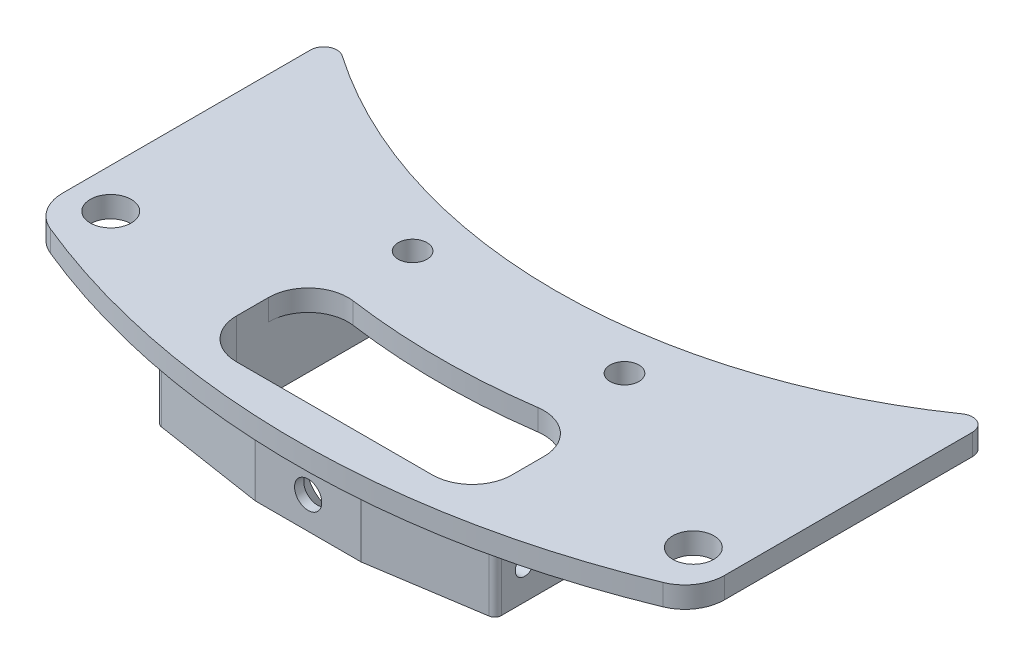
ISO-10303-21;
HEADER;
FILE_DESCRIPTION(('STEP AP214'),'2;1');
FILE_NAME('part.step','',(''),(''),'','','');
FILE_SCHEMA(('AUTOMOTIVE_DESIGN { 1 0 10303 214 1 1 1 1 }'));
ENDSEC;
DATA;
#1=APPLICATION_CONTEXT('core data for automotive mechanical design processes');
#2=APPLICATION_PROTOCOL_DEFINITION('international standard','automotive_design',2000,#1);
#3=PRODUCT_CONTEXT('',#1,'mechanical');
#4=PRODUCT('Part','Part','',(#3));
#5=PRODUCT_RELATED_PRODUCT_CATEGORY('part','',(#4));
#6=PRODUCT_DEFINITION_FORMATION('','',#4);
#7=PRODUCT_DEFINITION_CONTEXT('part definition',#1,'design');
#8=PRODUCT_DEFINITION('design','',#6,#7);
#9=PRODUCT_DEFINITION_SHAPE('','',#8);
#10=(LENGTH_UNIT() NAMED_UNIT(*) SI_UNIT(.MILLI.,.METRE.));
#11=(NAMED_UNIT(*) PLANE_ANGLE_UNIT() SI_UNIT($,.RADIAN.));
#12=(NAMED_UNIT(*) SI_UNIT($,.STERADIAN.) SOLID_ANGLE_UNIT());
#13=UNCERTAINTY_MEASURE_WITH_UNIT(LENGTH_MEASURE(1.E-05),#10,'distance_accuracy_value','');
#14=(GEOMETRIC_REPRESENTATION_CONTEXT(3) GLOBAL_UNCERTAINTY_ASSIGNED_CONTEXT((#13)) GLOBAL_UNIT_ASSIGNED_CONTEXT((#10,
#11,#12)) REPRESENTATION_CONTEXT('',''));
#15=CARTESIAN_POINT('',(0.,0.,0.));
#16=DIRECTION('',(0.,0.,1.));
#17=DIRECTION('',(1.,0.,0.));
#18=AXIS2_PLACEMENT_3D('',#15,#16,#17);
#19=CARTESIAN_POINT('',(0.,0.,0.));
#20=DIRECTION('',(0.,1.,0.));
#21=DIRECTION('',(0.,0.,1.));
#22=AXIS2_PLACEMENT_3D('',#19,#20,#21);
#23=PLANE('',#22);
#24=CARTESIAN_POINT('',(34.9249999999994,0.,83.8199999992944));
#25=DIRECTION('',(0.,-1.,0.));
#26=DIRECTION('',(0.,0.,-1.));
#27=AXIS2_PLACEMENT_3D('',#24,#25,#26);
#28=CIRCLE('',#27,2.45744999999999);
#29=CARTESIAN_POINT('',(34.9249999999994,0.,81.3625499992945));
#30=VERTEX_POINT('',#29);
#31=EDGE_CURVE('E664',#30,#30,#28,.T.);
#32=ORIENTED_EDGE('',*,*,#31,.F.);
#33=EDGE_LOOP('',(#32));
#34=FACE_BOUND('',#33,.T.);
#35=CARTESIAN_POINT('',(-34.9250000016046,0.,83.8200000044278));
#36=DIRECTION('',(0.,-1.,0.));
#37=DIRECTION('',(0.,0.,-1.));
#38=AXIS2_PLACEMENT_3D('',#35,#36,#37);
#39=CIRCLE('',#38,2.45744999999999);
#40=CARTESIAN_POINT('',(-34.9250000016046,0.,81.3625500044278));
#41=VERTEX_POINT('',#40);
#42=EDGE_CURVE('E658',#41,#41,#39,.T.);
#43=ORIENTED_EDGE('',*,*,#42,.F.);
#44=EDGE_LOOP('',(#43));
#45=FACE_BOUND('',#44,.T.);
#46=DIRECTION('',(0.,0.,1.));
#47=VECTOR('',#46,1.);
#48=CARTESIAN_POINT('',(-39.6874999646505,0.,84.8509468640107));
#49=LINE('',#48,#47);
#50=CARTESIAN_POINT('',(-39.6874999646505,0.,55.103403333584));
#51=VERTEX_POINT('',#50);
#52=CARTESIAN_POINT('',(-39.6874999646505,0.,84.8509468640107));
#53=VERTEX_POINT('',#52);
#54=EDGE_CURVE('E424',#51,#53,#49,.T.);
#55=ORIENTED_EDGE('',*,*,#54,.F.);
#56=CARTESIAN_POINT('',(-38.0999999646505,0.,55.103403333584));
#57=DIRECTION('',(0.,1.,0.));
#58=DIRECTION('',(0.,0.,1.));
#59=AXIS2_PLACEMENT_3D('',#56,#57,#58);
#60=CIRCLE('',#59,1.5875);
#61=CARTESIAN_POINT('',(-37.1971563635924,0.,53.7976354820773));
#62=VERTEX_POINT('',#61);
#63=EDGE_CURVE('E477',#51,#62,#60,.F.);
#64=ORIENTED_EDGE('',*,*,#63,.T.);
#65=CARTESIAN_POINT('',(0.,0.,0.));
#66=DIRECTION('',(0.,-1.,0.));
#67=DIRECTION('',(0.,0.,1.));
#68=AXIS2_PLACEMENT_3D('',#65,#66,#67);
#69=CIRCLE('',#68,65.405);
#70=CARTESIAN_POINT('',(-18.2886018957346,0.,62.7960274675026));
#71=VERTEX_POINT('',#70);
#72=EDGE_CURVE('E406',#71,#62,#69,.T.);
#73=ORIENTED_EDGE('',*,*,#72,.F.);
#74=CARTESIAN_POINT('',(-18.7325,0.,64.3202028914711));
#75=DIRECTION('',(0.,1.,0.));
#76=DIRECTION('',(0.,0.,1.));
#77=AXIS2_PLACEMENT_3D('',#74,#75,#76);
#78=CIRCLE('',#77,1.5875);
#79=CARTESIAN_POINT('',(-20.32,0.,64.3202028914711));
#80=VERTEX_POINT('',#79);
#81=EDGE_CURVE('E489',#71,#80,#78,.T.);
#82=ORIENTED_EDGE('',*,*,#81,.T.);
#83=DIRECTION('',(0.,0.,-1.));
#84=VECTOR('',#83,1.);
#85=CARTESIAN_POINT('',(-20.32,0.,62.1684134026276));
#86=LINE('',#85,#84);
#87=CARTESIAN_POINT('',(-20.32,0.,92.2358723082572));
#88=VERTEX_POINT('',#87);
#89=EDGE_CURVE('E340',#88,#80,#86,.T.);
#90=ORIENTED_EDGE('',*,*,#89,.F.);
#91=CARTESIAN_POINT('',(-19.52625,0.,92.2358723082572));
#92=DIRECTION('',(0.,-1.,0.));
#93=DIRECTION('',(0.,0.,-1.));
#94=AXIS2_PLACEMENT_3D('',#91,#92,#93);
#95=CIRCLE('',#94,0.793749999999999);
#96=CARTESIAN_POINT('',(-19.6474812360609,0.,93.0203097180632));
#97=VERTEX_POINT('',#96);
#98=EDGE_CURVE('E337',#97,#88,#95,.T.);
#99=ORIENTED_EDGE('',*,*,#98,.F.);
#100=DIRECTION('',(-0.988267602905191,0.,-0.152732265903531));
#101=VECTOR('',#100,1.);
#102=CARTESIAN_POINT('',(-19.6474812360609,0.,93.0203097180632));
#103=LINE('',#102,#101);
#104=CARTESIAN_POINT('',(-6.41025793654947,0.,95.0660624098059));
#105=VERTEX_POINT('',#104);
#106=EDGE_CURVE('E334',#105,#97,#103,.T.);
#107=ORIENTED_EDGE('',*,*,#106,.F.);
#108=CARTESIAN_POINT('',(-6.28902670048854,0.,94.2816249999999));
#109=DIRECTION('',(0.,-1.,0.));
#110=DIRECTION('',(0.,0.,-1.));
#111=AXIS2_PLACEMENT_3D('',#108,#109,#110);
#112=CIRCLE('',#111,0.793749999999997);
#113=CARTESIAN_POINT('',(-6.28902670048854,0.,95.0753749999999));
#114=VERTEX_POINT('',#113);
#115=EDGE_CURVE('E331',#114,#105,#112,.T.);
#116=ORIENTED_EDGE('',*,*,#115,.F.);
#117=DIRECTION('',(-1.,0.,0.));
#118=VECTOR('',#117,1.);
#119=CARTESIAN_POINT('',(-6.28902670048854,0.,95.0753749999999));
#120=LINE('',#119,#118);
#121=CARTESIAN_POINT('',(6.2890267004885,0.,95.0753749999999));
#122=VERTEX_POINT('',#121);
#123=EDGE_CURVE('E328',#122,#114,#120,.T.);
#124=ORIENTED_EDGE('',*,*,#123,.F.);
#125=CARTESIAN_POINT('',(6.2890267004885,0.,94.2816249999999));
#126=DIRECTION('',(0.,-1.,0.));
#127=DIRECTION('',(0.,0.,-1.));
#128=AXIS2_PLACEMENT_3D('',#125,#126,#127);
#129=CIRCLE('',#128,0.793749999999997);
#130=CARTESIAN_POINT('',(6.41025793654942,0.,95.0660624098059));
#131=VERTEX_POINT('',#130);
#132=EDGE_CURVE('E325',#131,#122,#129,.T.);
#133=ORIENTED_EDGE('',*,*,#132,.F.);
#134=DIRECTION('',(-0.988267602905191,0.,0.152732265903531));
#135=VECTOR('',#134,1.);
#136=CARTESIAN_POINT('',(6.41025793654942,0.,95.0660624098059));
#137=LINE('',#136,#135);
#138=CARTESIAN_POINT('',(19.6474812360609,0.,93.0203097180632));
#139=VERTEX_POINT('',#138);
#140=EDGE_CURVE('E322',#139,#131,#137,.T.);
#141=ORIENTED_EDGE('',*,*,#140,.F.);
#142=CARTESIAN_POINT('',(19.52625,0.,92.2358723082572));
#143=DIRECTION('',(0.,-1.,0.));
#144=DIRECTION('',(0.,0.,-1.));
#145=AXIS2_PLACEMENT_3D('',#142,#143,#144);
#146=CIRCLE('',#145,0.793749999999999);
#147=CARTESIAN_POINT('',(20.32,0.,92.2358723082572));
#148=VERTEX_POINT('',#147);
#149=EDGE_CURVE('E319',#148,#139,#146,.T.);
#150=ORIENTED_EDGE('',*,*,#149,.F.);
#151=DIRECTION('',(0.,0.,1.));
#152=VECTOR('',#151,1.);
#153=CARTESIAN_POINT('',(20.32,0.,62.1684134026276));
#154=LINE('',#153,#152);
#155=CARTESIAN_POINT('',(20.32,0.,64.3202028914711));
#156=VERTEX_POINT('',#155);
#157=EDGE_CURVE('E312',#156,#148,#154,.T.);
#158=ORIENTED_EDGE('',*,*,#157,.F.);
#159=CARTESIAN_POINT('',(18.7325,0.,64.3202028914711));
#160=DIRECTION('',(0.,1.,0.));
#161=DIRECTION('',(0.,0.,1.));
#162=AXIS2_PLACEMENT_3D('',#159,#160,#161);
#163=CIRCLE('',#162,1.5875);
#164=CARTESIAN_POINT('',(18.2886018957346,0.,62.7960274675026));
#165=VERTEX_POINT('',#164);
#166=EDGE_CURVE('E486',#156,#165,#163,.T.);
#167=ORIENTED_EDGE('',*,*,#166,.T.);
#168=CARTESIAN_POINT('',(37.1971563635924,0.,53.7976354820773));
#169=VERTEX_POINT('',#168);
#170=EDGE_CURVE('E422',#169,#165,#69,.T.);
#171=ORIENTED_EDGE('',*,*,#170,.F.);
#172=CARTESIAN_POINT('',(38.0999999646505,0.,55.103403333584));
#173=DIRECTION('',(0.,1.,0.));
#174=DIRECTION('',(0.,0.,1.));
#175=AXIS2_PLACEMENT_3D('',#172,#173,#174);
#176=CIRCLE('',#175,1.5875);
#177=CARTESIAN_POINT('',(39.6874999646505,0.,55.103403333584));
#178=VERTEX_POINT('',#177);
#179=EDGE_CURVE('E475',#169,#178,#176,.F.);
#180=ORIENTED_EDGE('',*,*,#179,.T.);
#181=DIRECTION('',(0.,0.,-1.));
#182=VECTOR('',#181,1.);
#183=CARTESIAN_POINT('',(39.6874999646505,0.,51.9876559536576));
#184=LINE('',#183,#182);
#185=CARTESIAN_POINT('',(39.6874999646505,0.,84.8509468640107));
#186=VERTEX_POINT('',#185);
#187=EDGE_CURVE('E411',#186,#178,#184,.T.);
#188=ORIENTED_EDGE('',*,*,#187,.F.);
#189=CARTESIAN_POINT('',(34.9249999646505,0.,84.8509468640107));
#190=DIRECTION('',(0.,1.,0.));
#191=DIRECTION('',(0.,0.,1.));
#192=AXIS2_PLACEMENT_3D('',#189,#190,#191);
#193=CIRCLE('',#192,4.7625);
#194=CARTESIAN_POINT('',(36.7377162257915,0.,89.2549752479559));
#195=VERTEX_POINT('',#194);
#196=EDGE_CURVE('E431',#195,#186,#193,.T.);
#197=ORIENTED_EDGE('',*,*,#196,.F.);
#198=CARTESIAN_POINT('',(0.,0.,0.));
#199=DIRECTION('',(0.,1.,0.));
#200=DIRECTION('',(0.,0.,1.));
#201=AXIS2_PLACEMENT_3D('',#198,#199,#200);
#202=CIRCLE('',#201,96.52);
#203=CARTESIAN_POINT('',(-36.7377162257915,0.,89.2549752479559));
#204=VERTEX_POINT('',#203);
#205=EDGE_CURVE('E429',#204,#195,#202,.T.);
#206=ORIENTED_EDGE('',*,*,#205,.F.);
#207=CARTESIAN_POINT('',(-34.9249999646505,0.,84.8509468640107));
#208=DIRECTION('',(0.,1.,0.));
#209=DIRECTION('',(0.,0.,-1.));
#210=AXIS2_PLACEMENT_3D('',#207,#208,#209);
#211=CIRCLE('',#210,4.7625);
#212=EDGE_CURVE('E427',#53,#204,#211,.T.);
#213=ORIENTED_EDGE('',*,*,#212,.F.);
#214=EDGE_LOOP('',(#55,#64,#73,#82,#90,#99,#107,#116,#124,#133,#141,#150,#158,#167,#171,#180,
#188,#197,#206,#213));
#215=FACE_BOUND('',#214,.T.);
#216=ADVANCED_FACE('F37',(#34,#45,#215),#23,.F.);
#217=CARTESIAN_POINT('',(12.7,0.,69.85));
#218=DIRECTION('',(0.,-1.,0.));
#219=DIRECTION('',(0.,0.,-1.));
#220=AXIS2_PLACEMENT_3D('',#217,#218,#219);
#221=CIRCLE('',#220,1.72719999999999);
#222=CARTESIAN_POINT('',(12.7,0.,68.1228));
#223=VERTEX_POINT('',#222);
#224=EDGE_CURVE('E675',#223,#223,#221,.T.);
#225=ORIENTED_EDGE('',*,*,#224,.F.);
#226=EDGE_LOOP('',(#225));
#227=FACE_BOUND('',#226,.T.);
#228=CARTESIAN_POINT('',(-12.7,0.,69.85));
#229=DIRECTION('',(0.,-1.,0.));
#230=DIRECTION('',(0.,0.,-1.));
#231=AXIS2_PLACEMENT_3D('',#228,#229,#230);
#232=CIRCLE('',#231,1.72719999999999);
#233=CARTESIAN_POINT('',(-12.7,0.,68.1228));
#234=VERTEX_POINT('',#233);
#235=EDGE_CURVE('E670',#234,#234,#232,.T.);
#236=ORIENTED_EDGE('',*,*,#235,.F.);
#237=EDGE_LOOP('',(#236));
#238=FACE_BOUND('',#237,.T.);
#239=DIRECTION('',(0.,0.,-1.));
#240=VECTOR('',#239,1.);
#241=CARTESIAN_POINT('',(16.51,0.,63.2869174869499));
#242=LINE('',#241,#240);
#243=CARTESIAN_POINT('',(16.51,0.,83.3133551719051));
#244=VERTEX_POINT('',#243);
#245=CARTESIAN_POINT('',(16.51,0.,64.5017484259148));
#246=VERTEX_POINT('',#245);
#247=EDGE_CURVE('E314',#244,#246,#242,.T.);
#248=ORIENTED_EDGE('',*,*,#247,.F.);
#249=CARTESIAN_POINT('',(11.7475,0.,83.3133551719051));
#250=DIRECTION('',(0.,1.,0.));
#251=DIRECTION('',(0.,0.,-1.));
#252=AXIS2_PLACEMENT_3D('',#249,#250,#251);
#253=CIRCLE('',#252,4.76250000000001);
#254=CARTESIAN_POINT('',(11.0825471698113,0.,78.5975048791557));
#255=VERTEX_POINT('',#254);
#256=EDGE_CURVE('E387',#244,#255,#253,.T.);
#257=ORIENTED_EDGE('',*,*,#256,.T.);
#258=CARTESIAN_POINT('',(0.,0.,0.));
#259=DIRECTION('',(0.,-1.,0.));
#260=DIRECTION('',(0.,0.,-1.));
#261=AXIS2_PLACEMENT_3D('',#258,#259,#260);
#262=CIRCLE('',#261,79.375);
#263=CARTESIAN_POINT('',(-11.0825471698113,0.,78.5975048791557));
#264=VERTEX_POINT('',#263);
#265=EDGE_CURVE('E369',#255,#264,#262,.T.);
#266=ORIENTED_EDGE('',*,*,#265,.T.);
#267=CARTESIAN_POINT('',(-11.7475,0.,83.3133551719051));
#268=DIRECTION('',(0.,1.,0.));
#269=DIRECTION('',(0.,0.,1.));
#270=AXIS2_PLACEMENT_3D('',#267,#268,#269);
#271=CIRCLE('',#270,4.76250000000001);
#272=CARTESIAN_POINT('',(-16.51,0.,83.3133551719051));
#273=VERTEX_POINT('',#272);
#274=EDGE_CURVE('E366',#264,#273,#271,.T.);
#275=ORIENTED_EDGE('',*,*,#274,.T.);
#276=DIRECTION('',(0.,0.,1.));
#277=VECTOR('',#276,1.);
#278=CARTESIAN_POINT('',(-16.51,0.,63.2869174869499));
#279=LINE('',#278,#277);
#280=CARTESIAN_POINT('',(-16.51,0.,64.5017484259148));
#281=VERTEX_POINT('',#280);
#282=EDGE_CURVE('E310',#281,#273,#279,.T.);
#283=ORIENTED_EDGE('',*,*,#282,.F.);
#284=CARTESIAN_POINT('',(-18.0975,0.,64.5017484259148));
#285=DIRECTION('',(0.,1.,0.));
#286=DIRECTION('',(0.,0.,1.));
#287=AXIS2_PLACEMENT_3D('',#284,#285,#286);
#288=CIRCLE('',#287,1.5875);
#289=CARTESIAN_POINT('',(-17.6686492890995,0.,62.9732709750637));
#290=VERTEX_POINT('',#289);
#291=EDGE_CURVE('E46',#281,#290,#288,.T.);
#292=ORIENTED_EDGE('',*,*,#291,.T.);
#293=CARTESIAN_POINT('',(17.6686492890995,0.,62.9732709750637));
#294=VERTEX_POINT('',#293);
#295=EDGE_CURVE('E425',#294,#290,#69,.T.);
#296=ORIENTED_EDGE('',*,*,#295,.F.);
#297=CARTESIAN_POINT('',(18.0975,0.,64.5017484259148));
#298=DIRECTION('',(0.,1.,0.));
#299=DIRECTION('',(0.,0.,1.));
#300=AXIS2_PLACEMENT_3D('',#297,#298,#299);
#301=CIRCLE('',#300,1.5875);
#302=EDGE_CURVE('E11',#294,#246,#301,.T.);
#303=ORIENTED_EDGE('',*,*,#302,.T.);
#304=EDGE_LOOP('',(#248,#257,#266,#275,#283,#292,#296,#303));
#305=FACE_BOUND('',#304,.T.);
#306=ADVANCED_FACE('F542',(#227,#238,#305),#23,.F.);
#307=CARTESIAN_POINT('',(0.,2.54,0.));
#308=DIRECTION('',(0.,1.,0.));
#309=DIRECTION('',(0.,0.,1.));
#310=AXIS2_PLACEMENT_3D('',#307,#308,#309);
#311=PLANE('',#310);
#312=CARTESIAN_POINT('',(12.7,2.54,69.85));
#313=DIRECTION('',(0.,-1.,0.));
#314=DIRECTION('',(0.,0.,-1.));
#315=AXIS2_PLACEMENT_3D('',#312,#313,#314);
#316=CIRCLE('',#315,1.72719999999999);
#317=CARTESIAN_POINT('',(12.7,2.54,68.1228));
#318=VERTEX_POINT('',#317);
#319=EDGE_CURVE('E673',#318,#318,#316,.T.);
#320=ORIENTED_EDGE('',*,*,#319,.T.);
#321=EDGE_LOOP('',(#320));
#322=FACE_BOUND('',#321,.T.);
#323=CARTESIAN_POINT('',(-12.7,2.54,69.85));
#324=DIRECTION('',(0.,-1.,0.));
#325=DIRECTION('',(0.,0.,-1.));
#326=AXIS2_PLACEMENT_3D('',#323,#324,#325);
#327=CIRCLE('',#326,1.72719999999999);
#328=CARTESIAN_POINT('',(-12.7,2.54,68.1228));
#329=VERTEX_POINT('',#328);
#330=EDGE_CURVE('E667',#329,#329,#327,.T.);
#331=ORIENTED_EDGE('',*,*,#330,.T.);
#332=EDGE_LOOP('',(#331));
#333=FACE_BOUND('',#332,.T.);
#334=CARTESIAN_POINT('',(34.9249999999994,2.54,83.8199999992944));
#335=DIRECTION('',(0.,-1.,0.));
#336=DIRECTION('',(0.,0.,-1.));
#337=AXIS2_PLACEMENT_3D('',#334,#335,#336);
#338=CIRCLE('',#337,2.45745);
#339=CARTESIAN_POINT('',(34.9249999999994,2.54,81.3625499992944));
#340=VERTEX_POINT('',#339);
#341=EDGE_CURVE('E661',#340,#340,#338,.T.);
#342=ORIENTED_EDGE('',*,*,#341,.T.);
#343=EDGE_LOOP('',(#342));
#344=FACE_BOUND('',#343,.T.);
#345=CARTESIAN_POINT('',(-34.9250000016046,2.54,83.8200000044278));
#346=DIRECTION('',(0.,-1.,0.));
#347=DIRECTION('',(0.,0.,-1.));
#348=AXIS2_PLACEMENT_3D('',#345,#346,#347);
#349=CIRCLE('',#348,2.45745);
#350=CARTESIAN_POINT('',(-34.9250000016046,2.54,81.3625500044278));
#351=VERTEX_POINT('',#350);
#352=EDGE_CURVE('E313',#351,#351,#349,.T.);
#353=ORIENTED_EDGE('',*,*,#352,.T.);
#354=EDGE_LOOP('',(#353));
#355=FACE_BOUND('',#354,.T.);
#356=CARTESIAN_POINT('',(0.,2.54,0.));
#357=DIRECTION('',(0.,-1.,0.));
#358=DIRECTION('',(0.,0.,1.));
#359=AXIS2_PLACEMENT_3D('',#356,#357,#358);
#360=CIRCLE('',#359,65.405);
#361=CARTESIAN_POINT('',(37.1971563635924,2.54,53.7976354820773));
#362=VERTEX_POINT('',#361);
#363=CARTESIAN_POINT('',(-37.1971563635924,2.54,53.7976354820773));
#364=VERTEX_POINT('',#363);
#365=EDGE_CURVE('E407',#362,#364,#360,.T.);
#366=ORIENTED_EDGE('',*,*,#365,.T.);
#367=CARTESIAN_POINT('',(-38.0999999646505,2.54,55.103403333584));
#368=DIRECTION('',(0.,1.,0.));
#369=DIRECTION('',(0.,0.,1.));
#370=AXIS2_PLACEMENT_3D('',#367,#368,#369);
#371=CIRCLE('',#370,1.5875);
#372=CARTESIAN_POINT('',(-39.6874999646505,2.54,55.103403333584));
#373=VERTEX_POINT('',#372);
#374=EDGE_CURVE('E481',#364,#373,#371,.T.);
#375=ORIENTED_EDGE('',*,*,#374,.T.);
#376=DIRECTION('',(0.,0.,1.));
#377=VECTOR('',#376,1.);
#378=CARTESIAN_POINT('',(-39.6874999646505,2.54,84.8509468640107));
#379=LINE('',#378,#377);
#380=CARTESIAN_POINT('',(-39.6874999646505,2.54,84.8509468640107));
#381=VERTEX_POINT('',#380);
#382=EDGE_CURVE('E410',#373,#381,#379,.T.);
#383=ORIENTED_EDGE('',*,*,#382,.T.);
#384=CARTESIAN_POINT('',(-34.9249999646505,2.54,84.8509468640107));
#385=DIRECTION('',(0.,1.,0.));
#386=DIRECTION('',(0.,0.,-1.));
#387=AXIS2_PLACEMENT_3D('',#384,#385,#386);
#388=CIRCLE('',#387,4.7625);
#389=CARTESIAN_POINT('',(-36.7377162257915,2.54,89.2549752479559));
#390=VERTEX_POINT('',#389);
#391=EDGE_CURVE('E413',#381,#390,#388,.T.);
#392=ORIENTED_EDGE('',*,*,#391,.T.);
#393=CARTESIAN_POINT('',(0.,2.54,0.));
#394=DIRECTION('',(0.,1.,0.));
#395=DIRECTION('',(0.,0.,1.));
#396=AXIS2_PLACEMENT_3D('',#393,#394,#395);
#397=CIRCLE('',#396,96.52);
#398=CARTESIAN_POINT('',(36.7377162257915,2.54,89.2549752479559));
#399=VERTEX_POINT('',#398);
#400=EDGE_CURVE('E415',#390,#399,#397,.T.);
#401=ORIENTED_EDGE('',*,*,#400,.T.);
#402=CARTESIAN_POINT('',(34.9249999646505,2.54,84.8509468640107));
#403=DIRECTION('',(0.,1.,0.));
#404=DIRECTION('',(0.,0.,1.));
#405=AXIS2_PLACEMENT_3D('',#402,#403,#404);
#406=CIRCLE('',#405,4.7625);
#407=CARTESIAN_POINT('',(39.6874999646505,2.54,84.8509468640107));
#408=VERTEX_POINT('',#407);
#409=EDGE_CURVE('E417',#399,#408,#406,.T.);
#410=ORIENTED_EDGE('',*,*,#409,.T.);
#411=DIRECTION('',(0.,0.,-1.));
#412=VECTOR('',#411,1.);
#413=CARTESIAN_POINT('',(39.6874999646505,2.54,51.9876559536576));
#414=LINE('',#413,#412);
#415=CARTESIAN_POINT('',(39.6874999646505,2.54,55.103403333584));
#416=VERTEX_POINT('',#415);
#417=EDGE_CURVE('E419',#408,#416,#414,.T.);
#418=ORIENTED_EDGE('',*,*,#417,.T.);
#419=CARTESIAN_POINT('',(38.0999999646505,2.54,55.103403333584));
#420=DIRECTION('',(0.,1.,0.));
#421=DIRECTION('',(0.,0.,1.));
#422=AXIS2_PLACEMENT_3D('',#419,#420,#421);
#423=CIRCLE('',#422,1.5875);
#424=EDGE_CURVE('E479',#416,#362,#423,.T.);
#425=ORIENTED_EDGE('',*,*,#424,.T.);
#426=EDGE_LOOP('',(#366,#375,#383,#392,#401,#410,#418,#425));
#427=FACE_BOUND('',#426,.T.);
#428=DIRECTION('',(0.,0.,1.));
#429=VECTOR('',#428,1.);
#430=CARTESIAN_POINT('',(-16.51,2.54,83.3133551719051));
#431=LINE('',#430,#429);
#432=CARTESIAN_POINT('',(-16.51,2.54,83.3133551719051));
#433=VERTEX_POINT('',#432);
#434=CARTESIAN_POINT('',(-16.51,2.54,87.1593884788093));
#435=VERTEX_POINT('',#434);
#436=EDGE_CURVE('E269',#433,#435,#431,.T.);
#437=ORIENTED_EDGE('',*,*,#436,.F.);
#438=CARTESIAN_POINT('',(-11.7475,2.54,83.3133551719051));
#439=DIRECTION('',(0.,1.,0.));
#440=DIRECTION('',(0.,0.,1.));
#441=AXIS2_PLACEMENT_3D('',#438,#439,#440);
#442=CIRCLE('',#441,4.76250000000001);
#443=CARTESIAN_POINT('',(-11.0825471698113,2.54,78.5975048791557));
#444=VERTEX_POINT('',#443);
#445=EDGE_CURVE('E367',#444,#433,#442,.T.);
#446=ORIENTED_EDGE('',*,*,#445,.F.);
#447=CARTESIAN_POINT('',(0.,2.54,0.));
#448=DIRECTION('',(0.,-1.,0.));
#449=DIRECTION('',(0.,0.,-1.));
#450=AXIS2_PLACEMENT_3D('',#447,#448,#449);
#451=CIRCLE('',#450,79.375);
#452=CARTESIAN_POINT('',(11.0825471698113,2.54,78.5975048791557));
#453=VERTEX_POINT('',#452);
#454=EDGE_CURVE('E382',#453,#444,#451,.T.);
#455=ORIENTED_EDGE('',*,*,#454,.F.);
#456=CARTESIAN_POINT('',(11.7475,2.54,83.3133551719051));
#457=DIRECTION('',(0.,1.,0.));
#458=DIRECTION('',(0.,0.,-1.));
#459=AXIS2_PLACEMENT_3D('',#456,#457,#458);
#460=CIRCLE('',#459,4.76250000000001);
#461=CARTESIAN_POINT('',(16.51,2.54,83.3133551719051));
#462=VERTEX_POINT('',#461);
#463=EDGE_CURVE('E379',#462,#453,#460,.T.);
#464=ORIENTED_EDGE('',*,*,#463,.F.);
#465=DIRECTION('',(0.,0.,-1.));
#466=VECTOR('',#465,1.);
#467=CARTESIAN_POINT('',(16.51,2.54,87.1593884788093));
#468=LINE('',#467,#466);
#469=CARTESIAN_POINT('',(16.51,2.54,87.1593884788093));
#470=VERTEX_POINT('',#469);
#471=EDGE_CURVE('E377',#470,#462,#468,.T.);
#472=ORIENTED_EDGE('',*,*,#471,.F.);
#473=CARTESIAN_POINT('',(11.7475,2.54,87.1593884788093));
#474=DIRECTION('',(0.,1.,0.));
#475=DIRECTION('',(0.,0.,1.));
#476=AXIS2_PLACEMENT_3D('',#473,#474,#475);
#477=CIRCLE('',#476,4.7625);
#478=CARTESIAN_POINT('',(11.7475,2.54,91.9218884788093));
#479=VERTEX_POINT('',#478);
#480=EDGE_CURVE('E375',#479,#470,#477,.T.);
#481=ORIENTED_EDGE('',*,*,#480,.F.);
#482=DIRECTION('',(1.,0.,0.));
#483=VECTOR('',#482,1.);
#484=CARTESIAN_POINT('',(-11.7475,2.54,91.9218884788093));
#485=LINE('',#484,#483);
#486=CARTESIAN_POINT('',(-11.7475,2.54,91.9218884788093));
#487=VERTEX_POINT('',#486);
#488=EDGE_CURVE('E373',#487,#479,#485,.T.);
#489=ORIENTED_EDGE('',*,*,#488,.F.);
#490=CARTESIAN_POINT('',(-11.7475,2.54,87.1593884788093));
#491=DIRECTION('',(0.,1.,0.));
#492=DIRECTION('',(0.,0.,1.));
#493=AXIS2_PLACEMENT_3D('',#490,#491,#492);
#494=CIRCLE('',#493,4.7625);
#495=EDGE_CURVE('E371',#435,#487,#494,.T.);
#496=ORIENTED_EDGE('',*,*,#495,.F.);
#497=EDGE_LOOP('',(#437,#446,#455,#464,#472,#481,#489,#496));
#498=FACE_BOUND('',#497,.T.);
#499=ADVANCED_FACE('F548',(#322,#333,#344,#355,#427,#498),#311,.T.);
#500=CARTESIAN_POINT('',(0.,2.54,0.));
#501=DIRECTION('',(0.,-1.,0.));
#502=DIRECTION('',(0.,0.,-1.));
#503=AXIS2_PLACEMENT_3D('',#500,#501,#502);
#504=CYLINDRICAL_SURFACE('',#503,65.405);
#505=ORIENTED_EDGE('',*,*,#170,.T.);
#506=DIRECTION('',(0.,-1.,0.));
#507=VECTOR('',#506,1.);
#508=CARTESIAN_POINT('',(18.2886018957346,2.54,62.7960274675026));
#509=LINE('',#508,#507);
#510=CARTESIAN_POINT('',(18.2886018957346,-7.62,62.7960274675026));
#511=VERTEX_POINT('',#510);
#512=EDGE_CURVE('E459',#165,#511,#509,.T.);
#513=ORIENTED_EDGE('',*,*,#512,.T.);
#514=CARTESIAN_POINT('',(0.,-7.62,0.));
#515=DIRECTION('',(0.,1.,0.));
#516=DIRECTION('',(0.,0.,-1.));
#517=AXIS2_PLACEMENT_3D('',#514,#515,#516);
#518=CIRCLE('',#517,65.405);
#519=CARTESIAN_POINT('',(17.6686492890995,-7.62,62.9732709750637));
#520=VERTEX_POINT('',#519);
#521=EDGE_CURVE('E288',#520,#511,#518,.T.);
#522=ORIENTED_EDGE('',*,*,#521,.F.);
#523=DIRECTION('',(0.,-1.,0.));
#524=VECTOR('',#523,1.);
#525=CARTESIAN_POINT('',(17.6686492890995,2.54,62.9732709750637));
#526=LINE('',#525,#524);
#527=EDGE_CURVE('E449',#520,#294,#526,.F.);
#528=ORIENTED_EDGE('',*,*,#527,.T.);
#529=ORIENTED_EDGE('',*,*,#295,.T.);
#530=DIRECTION('',(0.,-1.,0.));
#531=VECTOR('',#530,1.);
#532=CARTESIAN_POINT('',(-17.6686492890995,2.54,62.9732709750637));
#533=LINE('',#532,#531);
#534=CARTESIAN_POINT('',(-17.6686492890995,-7.62,62.9732709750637));
#535=VERTEX_POINT('',#534);
#536=EDGE_CURVE('E454',#290,#535,#533,.T.);
#537=ORIENTED_EDGE('',*,*,#536,.T.);
#538=CARTESIAN_POINT('',(0.,-7.62,0.));
#539=DIRECTION('',(0.,1.,0.));
#540=DIRECTION('',(0.,0.,-1.));
#541=AXIS2_PLACEMENT_3D('',#538,#539,#540);
#542=CIRCLE('',#541,65.405);
#543=CARTESIAN_POINT('',(-18.2886018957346,-7.62,62.7960274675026));
#544=VERTEX_POINT('',#543);
#545=EDGE_CURVE('E262',#544,#535,#542,.T.);
#546=ORIENTED_EDGE('',*,*,#545,.F.);
#547=DIRECTION('',(0.,-1.,0.));
#548=VECTOR('',#547,1.);
#549=CARTESIAN_POINT('',(-18.2886018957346,2.54,62.7960274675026));
#550=LINE('',#549,#548);
#551=EDGE_CURVE('E456',#544,#71,#550,.F.);
#552=ORIENTED_EDGE('',*,*,#551,.T.);
#553=ORIENTED_EDGE('',*,*,#72,.T.);
#554=DIRECTION('',(0.,-1.,0.));
#555=VECTOR('',#554,1.);
#556=CARTESIAN_POINT('',(-37.1971563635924,2.54,53.7976354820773));
#557=LINE('',#556,#555);
#558=EDGE_CURVE('E452',#62,#364,#557,.F.);
#559=ORIENTED_EDGE('',*,*,#558,.T.);
#560=ORIENTED_EDGE('',*,*,#365,.F.);
#561=DIRECTION('',(0.,-1.,0.));
#562=VECTOR('',#561,1.);
#563=CARTESIAN_POINT('',(37.1971563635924,2.54,53.7976354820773));
#564=LINE('',#563,#562);
#565=EDGE_CURVE('E446',#362,#169,#564,.T.);
#566=ORIENTED_EDGE('',*,*,#565,.T.);
#567=EDGE_LOOP('',(#505,#513,#522,#528,#529,#537,#546,#552,#553,#559,#560,#566));
#568=FACE_BOUND('',#567,.T.);
#569=ADVANCED_FACE('F574',(#568),#504,.F.);
#570=CARTESIAN_POINT('',(-39.6874999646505,2.54,84.8509468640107));
#571=DIRECTION('',(1.,0.,0.));
#572=DIRECTION('',(0.,0.,-1.));
#573=AXIS2_PLACEMENT_3D('',#570,#571,#572);
#574=PLANE('',#573);
#575=ORIENTED_EDGE('',*,*,#382,.F.);
#576=DIRECTION('',(0.,-1.,0.));
#577=VECTOR('',#576,1.);
#578=CARTESIAN_POINT('',(-39.6874999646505,2.54,55.103403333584));
#579=LINE('',#578,#577);
#580=EDGE_CURVE('E472',#373,#51,#579,.T.);
#581=ORIENTED_EDGE('',*,*,#580,.T.);
#582=ORIENTED_EDGE('',*,*,#54,.T.);
#583=DIRECTION('',(0.,-1.,0.));
#584=VECTOR('',#583,1.);
#585=CARTESIAN_POINT('',(-39.6874999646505,2.54,84.8509468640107));
#586=LINE('',#585,#584);
#587=EDGE_CURVE('E317',#381,#53,#586,.T.);
#588=ORIENTED_EDGE('',*,*,#587,.F.);
#589=EDGE_LOOP('',(#575,#581,#582,#588));
#590=FACE_BOUND('',#589,.T.);
#591=ADVANCED_FACE('F570',(#590),#574,.F.);
#592=CARTESIAN_POINT('',(-34.9249999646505,2.54,84.8509468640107));
#593=DIRECTION('',(0.,-1.,0.));
#594=DIRECTION('',(0.,0.,-1.));
#595=AXIS2_PLACEMENT_3D('',#592,#593,#594);
#596=CYLINDRICAL_SURFACE('',#595,4.7625);
#597=ORIENTED_EDGE('',*,*,#212,.T.);
#598=DIRECTION('',(0.,-1.,0.));
#599=VECTOR('',#598,1.);
#600=CARTESIAN_POINT('',(-36.7377162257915,2.54,89.2549752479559));
#601=LINE('',#600,#599);
#602=EDGE_CURVE('E439',#390,#204,#601,.T.);
#603=ORIENTED_EDGE('',*,*,#602,.F.);
#604=ORIENTED_EDGE('',*,*,#391,.F.);
#605=ORIENTED_EDGE('',*,*,#587,.T.);
#606=EDGE_LOOP('',(#597,#603,#604,#605));
#607=FACE_BOUND('',#606,.T.);
#608=ADVANCED_FACE('F566',(#607),#596,.T.);
#609=CARTESIAN_POINT('',(0.,2.54,0.));
#610=DIRECTION('',(0.,-1.,0.));
#611=DIRECTION('',(0.,0.,-1.));
#612=AXIS2_PLACEMENT_3D('',#609,#610,#611);
#613=CYLINDRICAL_SURFACE('',#612,96.52);
#614=ORIENTED_EDGE('',*,*,#205,.T.);
#615=DIRECTION('',(0.,-1.,0.));
#616=VECTOR('',#615,1.);
#617=CARTESIAN_POINT('',(36.7377162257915,2.54,89.2549752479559));
#618=LINE('',#617,#616);
#619=EDGE_CURVE('E436',#399,#195,#618,.T.);
#620=ORIENTED_EDGE('',*,*,#619,.F.);
#621=ORIENTED_EDGE('',*,*,#400,.F.);
#622=ORIENTED_EDGE('',*,*,#602,.T.);
#623=EDGE_LOOP('',(#614,#620,#621,#622));
#624=FACE_BOUND('',#623,.T.);
#625=ADVANCED_FACE('F562',(#624),#613,.T.);
#626=CARTESIAN_POINT('',(34.9249999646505,2.54,84.8509468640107));
#627=DIRECTION('',(0.,-1.,0.));
#628=DIRECTION('',(0.,0.,-1.));
#629=AXIS2_PLACEMENT_3D('',#626,#627,#628);
#630=CYLINDRICAL_SURFACE('',#629,4.7625);
#631=ORIENTED_EDGE('',*,*,#196,.T.);
#632=DIRECTION('',(0.,-1.,0.));
#633=VECTOR('',#632,1.);
#634=CARTESIAN_POINT('',(39.6874999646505,2.54,84.8509468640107));
#635=LINE('',#634,#633);
#636=EDGE_CURVE('E421',#408,#186,#635,.T.);
#637=ORIENTED_EDGE('',*,*,#636,.F.);
#638=ORIENTED_EDGE('',*,*,#409,.F.);
#639=ORIENTED_EDGE('',*,*,#619,.T.);
#640=EDGE_LOOP('',(#631,#637,#638,#639));
#641=FACE_BOUND('',#640,.T.);
#642=ADVANCED_FACE('F559',(#641),#630,.T.);
#643=CARTESIAN_POINT('',(39.6874999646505,2.54,51.9876559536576));
#644=DIRECTION('',(-1.,0.,0.));
#645=DIRECTION('',(0.,0.,1.));
#646=AXIS2_PLACEMENT_3D('',#643,#644,#645);
#647=PLANE('',#646);
#648=ORIENTED_EDGE('',*,*,#187,.T.);
#649=DIRECTION('',(0.,-1.,0.));
#650=VECTOR('',#649,1.);
#651=CARTESIAN_POINT('',(39.6874999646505,2.54,55.103403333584));
#652=LINE('',#651,#650);
#653=EDGE_CURVE('E60',#178,#416,#652,.F.);
#654=ORIENTED_EDGE('',*,*,#653,.T.);
#655=ORIENTED_EDGE('',*,*,#417,.F.);
#656=ORIENTED_EDGE('',*,*,#636,.T.);
#657=EDGE_LOOP('',(#648,#654,#655,#656));
#658=FACE_BOUND('',#657,.T.);
#659=ADVANCED_FACE('F555',(#658),#647,.F.);
#660=CARTESIAN_POINT('',(-11.7475,2.54,83.3133551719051));
#661=DIRECTION('',(0.,-1.,0.));
#662=DIRECTION('',(0.,0.,-1.));
#663=AXIS2_PLACEMENT_3D('',#660,#661,#662);
#664=CYLINDRICAL_SURFACE('',#663,4.76250000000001);
#665=ORIENTED_EDGE('',*,*,#274,.F.);
#666=DIRECTION('',(0.,-1.,0.));
#667=VECTOR('',#666,1.);
#668=CARTESIAN_POINT('',(-11.0825471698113,2.54,78.5975048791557));
#669=LINE('',#668,#667);
#670=EDGE_CURVE('E384',#444,#264,#669,.T.);
#671=ORIENTED_EDGE('',*,*,#670,.F.);
#672=ORIENTED_EDGE('',*,*,#445,.T.);
#673=DIRECTION('',(0.,-1.,0.));
#674=VECTOR('',#673,1.);
#675=CARTESIAN_POINT('',(-16.51,2.54,83.3133551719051));
#676=LINE('',#675,#674);
#677=EDGE_CURVE('E272',#433,#273,#676,.T.);
#678=ORIENTED_EDGE('',*,*,#677,.T.);
#679=EDGE_LOOP('',(#665,#671,#672,#678));
#680=FACE_BOUND('',#679,.T.);
#681=ADVANCED_FACE('F558',(#680),#664,.F.);
#682=CARTESIAN_POINT('',(-16.51,2.54,83.3133551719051));
#683=DIRECTION('',(1.,0.,0.));
#684=DIRECTION('',(0.,0.,-1.));
#685=AXIS2_PLACEMENT_3D('',#682,#683,#684);
#686=PLANE('',#685);
#687=DIRECTION('',(0.,0.,1.));
#688=VECTOR('',#687,1.);
#689=CARTESIAN_POINT('',(-16.51,-7.62,63.2869174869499));
#690=LINE('',#689,#688);
#691=CARTESIAN_POINT('',(-16.51,-7.62,64.5017484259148));
#692=VERTEX_POINT('',#691);
#693=CARTESIAN_POINT('',(-16.51,-7.62,87.1593884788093));
#694=VERTEX_POINT('',#693);
#695=EDGE_CURVE('E248',#692,#694,#690,.T.);
#696=ORIENTED_EDGE('',*,*,#695,.F.);
#697=DIRECTION('',(0.,1.,0.));
#698=VECTOR('',#697,1.);
#699=CARTESIAN_POINT('',(-16.51,0.,64.5017484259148));
#700=LINE('',#699,#698);
#701=EDGE_CURVE('E470',#692,#281,#700,.T.);
#702=ORIENTED_EDGE('',*,*,#701,.T.);
#703=ORIENTED_EDGE('',*,*,#282,.T.);
#704=ORIENTED_EDGE('',*,*,#677,.F.);
#705=ORIENTED_EDGE('',*,*,#436,.T.);
#706=DIRECTION('',(0.,-1.,0.));
#707=VECTOR('',#706,1.);
#708=CARTESIAN_POINT('',(-16.51,2.54,87.1593884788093));
#709=LINE('',#708,#707);
#710=EDGE_CURVE('E265',#435,#694,#709,.T.);
#711=ORIENTED_EDGE('',*,*,#710,.T.);
#712=EDGE_LOOP('',(#696,#702,#703,#704,#705,#711));
#713=FACE_BOUND('',#712,.T.);
#714=ADVANCED_FACE('F266',(#713),#686,.T.);
#715=CARTESIAN_POINT('',(-11.7475,2.54,87.1593884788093));
#716=DIRECTION('',(0.,-1.,0.));
#717=DIRECTION('',(0.,0.,-1.));
#718=AXIS2_PLACEMENT_3D('',#715,#716,#717);
#719=CYLINDRICAL_SURFACE('',#718,4.7625);
#720=CARTESIAN_POINT('',(-15.0767163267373,-3.81,90.5649317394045));
#721=CARTESIAN_POINT('',(-15.076719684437,-3.86144906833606,90.5649292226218));
#722=CARTESIAN_POINT('',(-15.0803538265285,-3.91291451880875,90.561387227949));
#723=CARTESIAN_POINT('',(-15.0944196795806,-4.01397686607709,90.5475481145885));
#724=CARTESIAN_POINT('',(-15.1048590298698,-4.06357159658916,90.5372434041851));
#725=CARTESIAN_POINT('',(-15.1312437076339,-4.15907900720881,90.510809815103));
#726=CARTESIAN_POINT('',(-15.1471400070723,-4.20502013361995,90.4947327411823));
#727=CARTESIAN_POINT('',(-15.1831513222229,-4.29305919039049,90.4576267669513));
#728=CARTESIAN_POINT('',(-15.2032692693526,-4.33515442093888,90.4365944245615));
#729=CARTESIAN_POINT('',(-15.2567471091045,-4.43413316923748,90.3794423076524));
#730=CARTESIAN_POINT('',(-15.2918820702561,-4.48864830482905,90.3408812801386));
#731=CARTESIAN_POINT('',(-15.3658808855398,-4.58875931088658,90.2564665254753));
#732=CARTESIAN_POINT('',(-15.4047507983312,-4.63434031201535,90.2106008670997));
#733=CARTESIAN_POINT('',(-15.4850831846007,-4.71743770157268,90.1116798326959));
#734=CARTESIAN_POINT('',(-15.5265838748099,-4.7547546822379,90.0584885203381));
#735=CARTESIAN_POINT('',(-15.6097890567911,-4.81973577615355,89.9466796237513));
#736=CARTESIAN_POINT('',(-15.6514935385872,-4.84740035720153,89.8880623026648));
#737=CARTESIAN_POINT('',(-15.7404719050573,-4.89612847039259,89.7564724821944));
#738=CARTESIAN_POINT('',(-15.7875642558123,-4.91541770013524,89.6827066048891));
#739=CARTESIAN_POINT('',(-15.8785408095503,-4.93881342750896,89.5308294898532));
#740=CARTESIAN_POINT('',(-15.9224249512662,-4.94291963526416,89.4527181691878));
#741=CARTESIAN_POINT('',(-16.002795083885,-4.93466324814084,89.2996854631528));
#742=CARTESIAN_POINT('',(-16.0395709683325,-4.92330511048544,89.224866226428));
#743=CARTESIAN_POINT('',(-16.1077168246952,-4.88488246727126,89.0768168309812));
#744=CARTESIAN_POINT('',(-16.1390938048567,-4.8578385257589,89.0035847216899));
#745=CARTESIAN_POINT('',(-16.1917059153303,-4.79292812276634,88.8724912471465));
#746=CARTESIAN_POINT('',(-16.2137481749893,-4.75713887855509,88.8139224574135));
#747=CARTESIAN_POINT('',(-16.253179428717,-4.67458240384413,88.7033135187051));
#748=CARTESIAN_POINT('',(-16.270571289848,-4.62782197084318,88.6512693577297));
#749=CARTESIAN_POINT('',(-16.2993253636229,-4.52987154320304,88.5609308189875));
#750=CARTESIAN_POINT('',(-16.3111165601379,-4.47959177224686,88.5217819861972));
#751=CARTESIAN_POINT('',(-16.3312948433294,-4.37267797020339,88.4522707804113));
#752=CARTESIAN_POINT('',(-16.3396827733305,-4.31604551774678,88.4219062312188));
#753=CARTESIAN_POINT('',(-16.3530924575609,-4.20031068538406,88.3720588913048));
#754=CARTESIAN_POINT('',(-16.3582264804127,-4.1413752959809,88.3522175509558));
#755=CARTESIAN_POINT('',(-16.3658264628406,-4.02088691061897,88.3224470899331));
#756=CARTESIAN_POINT('',(-16.368292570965,-3.95933406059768,88.3125174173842));
#757=CARTESIAN_POINT('',(-16.3706714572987,-3.83583286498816,88.3029428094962));
#758=CARTESIAN_POINT('',(-16.3706024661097,-3.77389054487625,88.3032244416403));
#759=CARTESIAN_POINT('',(-16.3679528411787,-3.65093498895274,88.3138802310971));
#760=CARTESIAN_POINT('',(-16.3653722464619,-3.5899217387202,88.3242542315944));
#761=CARTESIAN_POINT('',(-16.3575745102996,-3.4705863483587,88.3547395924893));
#762=CARTESIAN_POINT('',(-16.352358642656,-3.41226292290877,88.3748462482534));
#763=CARTESIAN_POINT('',(-16.3390730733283,-3.29992480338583,88.4241058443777));
#764=CARTESIAN_POINT('',(-16.3310034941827,-3.24590992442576,88.4532583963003));
#765=CARTESIAN_POINT('',(-16.3117393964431,-3.14357886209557,88.5196521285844));
#766=CARTESIAN_POINT('',(-16.3005389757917,-3.09527368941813,88.5569085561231));
#767=CARTESIAN_POINT('',(-16.2748055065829,-3.00573497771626,88.6381453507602));
#768=CARTESIAN_POINT('',(-16.2602724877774,-2.96450137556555,88.6821256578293));
#769=CARTESIAN_POINT('',(-16.2275301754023,-2.8894775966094,88.7759387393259));
#770=CARTESIAN_POINT('',(-16.2092703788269,-2.85580468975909,88.8258474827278));
#771=CARTESIAN_POINT('',(-16.1692662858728,-2.79722308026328,88.9292649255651));
#772=CARTESIAN_POINT('',(-16.1475214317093,-2.7723157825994,88.9827742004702));
#773=CARTESIAN_POINT('',(-16.0996161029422,-2.73038605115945,89.0944228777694));
#774=CARTESIAN_POINT('',(-16.0732901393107,-2.71381584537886,89.1526603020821));
#775=CARTESIAN_POINT('',(-16.0174923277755,-2.6902297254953,89.2695479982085));
#776=CARTESIAN_POINT('',(-15.9880191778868,-2.68321778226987,89.3281984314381));
#777=CARTESIAN_POINT('',(-15.9233979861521,-2.67799538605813,89.4503531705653));
#778=CARTESIAN_POINT('',(-15.8879773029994,-2.68074027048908,89.5137529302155));
#779=CARTESIAN_POINT('',(-15.8148725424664,-2.69636859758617,89.6379140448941));
#780=CARTESIAN_POINT('',(-15.7771877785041,-2.70925513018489,89.6986745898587));
#781=CARTESIAN_POINT('',(-15.6953772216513,-2.74672568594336,89.8243474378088));
#782=CARTESIAN_POINT('',(-15.651060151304,-2.77263468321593,89.8887412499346));
#783=CARTESIAN_POINT('',(-15.5621176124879,-2.83567089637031,90.0117341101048));
#784=CARTESIAN_POINT('',(-15.5174917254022,-2.87281875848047,90.0703222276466));
#785=CARTESIAN_POINT('',(-15.4258853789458,-2.96166182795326,90.1854018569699));
#786=CARTESIAN_POINT('',(-15.3790491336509,-3.0143579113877,90.2412420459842));
#787=CARTESIAN_POINT('',(-15.2904992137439,-3.13241017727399,90.3426351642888));
#788=CARTESIAN_POINT('',(-15.2487702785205,-3.19772706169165,90.3882190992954));
#789=CARTESIAN_POINT('',(-15.1902819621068,-3.31155408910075,90.4502368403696));
#790=CARTESIAN_POINT('',(-15.1702778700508,-3.35606254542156,90.4709789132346));
#791=CARTESIAN_POINT('',(-15.1351478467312,-3.44905981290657,90.5069065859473));
#792=CARTESIAN_POINT('',(-15.1200129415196,-3.49754109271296,90.5221024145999));
#793=CARTESIAN_POINT('',(-15.0979063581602,-3.58976828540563,90.5441175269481));
#794=CARTESIAN_POINT('',(-15.0900286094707,-3.63307025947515,90.5518747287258));
#795=CARTESIAN_POINT('',(-15.0794329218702,-3.72091098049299,90.5622821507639));
#796=CARTESIAN_POINT('',(-15.0767134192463,-3.76544934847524,90.5649339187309));
#797=CARTESIAN_POINT('',(-15.0767163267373,-3.81,90.5649317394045));
#798=B_SPLINE_CURVE_WITH_KNOTS('',3,(#720,#721,#722,#723,#724,#725,#726,#727,#728,#729,#730,
#731,#732,#733,#734,#735,#736,#737,#738,#739,#740,#741,#742,#743,#744,#745,#746,#747,#748,#749,
#750,#751,#752,#753,#754,#755,#756,#757,#758,#759,#760,#761,#762,#763,#764,#765,#766,#767,#768,
#769,#770,#771,#772,#773,#774,#775,#776,#777,#778,#779,#780,#781,#782,#783,#784,#785,#786,#787,
#788,#789,#790,#791,#792,#793,#794,#795,#796,#797),.UNSPECIFIED.,.T.,.F.,(4,2,2,2,2,2,2,2,2,2,2,
2,2,2,2,2,2,2,2,2,2,2,2,2,2,2,2,2,2,2,2,2,2,2,2,2,2,2,4),(0.,0.154142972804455,
0.308459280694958,0.461423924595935,0.614495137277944,0.839633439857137,1.06514332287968,
1.29561274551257,1.52607099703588,1.79355035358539,2.06103481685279,2.31194905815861,
2.56253509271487,2.77760422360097,2.99254045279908,3.18598831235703,3.37938820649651,
3.56568838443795,3.75197818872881,3.93692859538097,4.12187612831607,4.30673434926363,
4.49158463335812,4.67678576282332,4.86198523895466,5.0498844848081,5.23781383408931,
5.43506198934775,5.63239206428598,5.8495531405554,6.06678040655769,6.31282427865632,
6.55932291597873,6.82777268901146,7.09539966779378,7.25393811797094,7.41218268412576,
7.54569827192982,7.67917337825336),.UNSPECIFIED.);
#799=CARTESIAN_POINT('',(-15.0767163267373,-3.81,90.5649317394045));
#800=VERTEX_POINT('',#799);
#801=EDGE_CURVE('E492',#800,#800,#798,.T.);
#802=ORIENTED_EDGE('',*,*,#801,.F.);
#803=EDGE_LOOP('',(#802));
#804=FACE_BOUND('',#803,.T.);
#805=DIRECTION('',(0.,-1.,0.));
#806=VECTOR('',#805,1.);
#807=CARTESIAN_POINT('',(-11.7475,2.54,91.9218884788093));
#808=LINE('',#807,#806);
#809=CARTESIAN_POINT('',(-11.7475,-7.62,91.9218884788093));
#810=VERTEX_POINT('',#809);
#811=EDGE_CURVE('E273',#487,#810,#808,.T.);
#812=ORIENTED_EDGE('',*,*,#811,.T.);
#813=CARTESIAN_POINT('',(-11.7475,-7.62,87.1593884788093));
#814=DIRECTION('',(0.,1.,0.));
#815=DIRECTION('',(0.,0.,-1.));
#816=AXIS2_PLACEMENT_3D('',#813,#814,#815);
#817=CIRCLE('',#816,4.7625);
#818=EDGE_CURVE('E254',#694,#810,#817,.T.);
#819=ORIENTED_EDGE('',*,*,#818,.F.);
#820=ORIENTED_EDGE('',*,*,#710,.F.);
#821=ORIENTED_EDGE('',*,*,#495,.T.);
#822=EDGE_LOOP('',(#812,#819,#820,#821));
#823=FACE_BOUND('',#822,.T.);
#824=ADVANCED_FACE('F275',(#804,#823),#719,.F.);
#825=CARTESIAN_POINT('',(-11.7475,2.54,91.9218884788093));
#826=DIRECTION('',(0.,0.,-1.));
#827=DIRECTION('',(-1.,0.,0.));
#828=AXIS2_PLACEMENT_3D('',#825,#826,#827);
#829=PLANE('',#828);
#830=CARTESIAN_POINT('',(0.,-3.81,91.9218884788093));
#831=DIRECTION('',(0.,0.,-1.));
#832=DIRECTION('',(-1.,0.,0.));
#833=AXIS2_PLACEMENT_3D('',#830,#831,#832);
#834=CIRCLE('',#833,3.4094928);
#835=CARTESIAN_POINT('',(-3.4094928,-3.81,91.9218884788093));
#836=VERTEX_POINT('',#835);
#837=EDGE_CURVE('E853',#836,#836,#834,.T.);
#838=ORIENTED_EDGE('',*,*,#837,.F.);
#839=EDGE_LOOP('',(#838));
#840=FACE_BOUND('',#839,.T.);
#841=DIRECTION('',(0.,-1.,0.));
#842=VECTOR('',#841,1.);
#843=CARTESIAN_POINT('',(11.7475,2.54,91.9218884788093));
#844=LINE('',#843,#842);
#845=CARTESIAN_POINT('',(11.7475,-7.62,91.9218884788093));
#846=VERTEX_POINT('',#845);
#847=EDGE_CURVE('E401',#479,#846,#844,.T.);
#848=ORIENTED_EDGE('',*,*,#847,.T.);
#849=DIRECTION('',(1.,0.,0.));
#850=VECTOR('',#849,1.);
#851=CARTESIAN_POINT('',(-11.7475,-7.62,91.9218884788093));
#852=LINE('',#851,#850);
#853=EDGE_CURVE('E277',#810,#846,#852,.T.);
#854=ORIENTED_EDGE('',*,*,#853,.F.);
#855=ORIENTED_EDGE('',*,*,#811,.F.);
#856=ORIENTED_EDGE('',*,*,#488,.T.);
#857=EDGE_LOOP('',(#848,#854,#855,#856));
#858=FACE_BOUND('',#857,.T.);
#859=ADVANCED_FACE('F530',(#840,#858),#829,.T.);
#860=CARTESIAN_POINT('',(11.7475,2.54,87.1593884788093));
#861=DIRECTION('',(0.,-1.,0.));
#862=DIRECTION('',(0.,0.,-1.));
#863=AXIS2_PLACEMENT_3D('',#860,#861,#862);
#864=CYLINDRICAL_SURFACE('',#863,4.7625);
#865=CARTESIAN_POINT('',(15.0767163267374,-3.81,90.5649317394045));
#866=CARTESIAN_POINT('',(15.076719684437,-3.75855093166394,90.5649292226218));
#867=CARTESIAN_POINT('',(15.0803538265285,-3.70708548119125,90.5613872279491));
#868=CARTESIAN_POINT('',(15.0944196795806,-3.60602313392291,90.5475481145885));
#869=CARTESIAN_POINT('',(15.1048590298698,-3.55642840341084,90.5372434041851));
#870=CARTESIAN_POINT('',(15.131243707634,-3.46092099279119,90.510809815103));
#871=CARTESIAN_POINT('',(15.1471400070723,-3.41497986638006,90.4947327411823));
#872=CARTESIAN_POINT('',(15.1831513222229,-3.32694080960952,90.4576267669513));
#873=CARTESIAN_POINT('',(15.2032692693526,-3.28484557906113,90.4365944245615));
#874=CARTESIAN_POINT('',(15.2567471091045,-3.18586683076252,90.3794423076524));
#875=CARTESIAN_POINT('',(15.2918820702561,-3.13135169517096,90.3408812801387));
#876=CARTESIAN_POINT('',(15.3658808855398,-3.03124068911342,90.2564665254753));
#877=CARTESIAN_POINT('',(15.4047507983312,-2.98565968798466,90.2106008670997));
#878=CARTESIAN_POINT('',(15.4850831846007,-2.90256229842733,90.1116798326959));
#879=CARTESIAN_POINT('',(15.5265838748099,-2.86524531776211,90.0584885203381));
#880=CARTESIAN_POINT('',(15.6097890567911,-2.80026422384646,89.9466796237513));
#881=CARTESIAN_POINT('',(15.6514935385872,-2.77259964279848,89.8880623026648));
#882=CARTESIAN_POINT('',(15.7404719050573,-2.72387152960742,89.7564724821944));
#883=CARTESIAN_POINT('',(15.7875642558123,-2.70458229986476,89.6827066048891));
#884=CARTESIAN_POINT('',(15.8785408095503,-2.68118657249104,89.5308294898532));
#885=CARTESIAN_POINT('',(15.9224249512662,-2.67708036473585,89.4527181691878));
#886=CARTESIAN_POINT('',(16.002795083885,-2.68533675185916,89.2996854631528));
#887=CARTESIAN_POINT('',(16.0395709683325,-2.69669488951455,89.2248662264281));
#888=CARTESIAN_POINT('',(16.1077168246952,-2.73511753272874,89.0768168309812));
#889=CARTESIAN_POINT('',(16.1390938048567,-2.7621614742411,89.00358472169));
#890=CARTESIAN_POINT('',(16.1917059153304,-2.82707187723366,88.8724912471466));
#891=CARTESIAN_POINT('',(16.2137481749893,-2.86286112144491,88.8139224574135));
#892=CARTESIAN_POINT('',(16.253179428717,-2.94541759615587,88.7033135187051));
#893=CARTESIAN_POINT('',(16.270571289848,-2.99217802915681,88.6512693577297));
#894=CARTESIAN_POINT('',(16.299325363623,-3.09012845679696,88.5609308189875));
#895=CARTESIAN_POINT('',(16.3111165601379,-3.14040822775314,88.5217819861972));
#896=CARTESIAN_POINT('',(16.3312948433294,-3.2473220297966,88.4522707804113));
#897=CARTESIAN_POINT('',(16.3396827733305,-3.30395448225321,88.4219062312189));
#898=CARTESIAN_POINT('',(16.3530924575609,-3.41968931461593,88.3720588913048));
#899=CARTESIAN_POINT('',(16.3582264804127,-3.47862470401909,88.3522175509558));
#900=CARTESIAN_POINT('',(16.3658264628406,-3.59911308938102,88.3224470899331));
#901=CARTESIAN_POINT('',(16.368292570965,-3.66066593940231,88.3125174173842));
#902=CARTESIAN_POINT('',(16.3706714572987,-3.78416713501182,88.3029428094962));
#903=CARTESIAN_POINT('',(16.3706024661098,-3.84610945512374,88.3032244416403));
#904=CARTESIAN_POINT('',(16.3679528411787,-3.96906501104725,88.3138802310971));
#905=CARTESIAN_POINT('',(16.3653722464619,-4.03007826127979,88.3242542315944));
#906=CARTESIAN_POINT('',(16.3575745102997,-4.14941365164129,88.3547395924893));
#907=CARTESIAN_POINT('',(16.3523586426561,-4.20773707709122,88.3748462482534));
#908=CARTESIAN_POINT('',(16.3390730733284,-4.32007519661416,88.4241058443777));
#909=CARTESIAN_POINT('',(16.3310034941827,-4.37409007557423,88.4532583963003));
#910=CARTESIAN_POINT('',(16.3117393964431,-4.47642113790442,88.5196521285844));
#911=CARTESIAN_POINT('',(16.3005389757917,-4.52472631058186,88.5569085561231));
#912=CARTESIAN_POINT('',(16.2748055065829,-4.61426502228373,88.6381453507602));
#913=CARTESIAN_POINT('',(16.2602724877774,-4.65549862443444,88.6821256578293));
#914=CARTESIAN_POINT('',(16.2275301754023,-4.73052240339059,88.7759387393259));
#915=CARTESIAN_POINT('',(16.2092703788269,-4.7641953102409,88.8258474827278));
#916=CARTESIAN_POINT('',(16.1692662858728,-4.82277691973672,88.9292649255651));
#917=CARTESIAN_POINT('',(16.1475214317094,-4.8476842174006,88.9827742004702));
#918=CARTESIAN_POINT('',(16.0996161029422,-4.88961394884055,89.0944228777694));
#919=CARTESIAN_POINT('',(16.0732901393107,-4.90618415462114,89.1526603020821));
#920=CARTESIAN_POINT('',(16.0174923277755,-4.9297702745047,89.2695479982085));
#921=CARTESIAN_POINT('',(15.9880191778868,-4.93678221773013,89.3281984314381));
#922=CARTESIAN_POINT('',(15.9233979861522,-4.94200461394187,89.4503531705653));
#923=CARTESIAN_POINT('',(15.8879773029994,-4.93925972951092,89.5137529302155));
#924=CARTESIAN_POINT('',(15.8148725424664,-4.92363140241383,89.6379140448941));
#925=CARTESIAN_POINT('',(15.7771877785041,-4.91074486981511,89.6986745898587));
#926=CARTESIAN_POINT('',(15.6953772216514,-4.87327431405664,89.8243474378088));
#927=CARTESIAN_POINT('',(15.651060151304,-4.84736531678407,89.8887412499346));
#928=CARTESIAN_POINT('',(15.5621176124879,-4.7843291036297,90.0117341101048));
#929=CARTESIAN_POINT('',(15.5174917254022,-4.74718124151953,90.0703222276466));
#930=CARTESIAN_POINT('',(15.4258853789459,-4.65833817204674,90.1854018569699));
#931=CARTESIAN_POINT('',(15.3790491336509,-4.60564208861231,90.2412420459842));
#932=CARTESIAN_POINT('',(15.2904992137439,-4.48758982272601,90.3426351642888));
#933=CARTESIAN_POINT('',(15.2487702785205,-4.42227293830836,90.3882190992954));
#934=CARTESIAN_POINT('',(15.1902819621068,-4.30844591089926,90.4502368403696));
#935=CARTESIAN_POINT('',(15.1702778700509,-4.26393745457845,90.4709789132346));
#936=CARTESIAN_POINT('',(15.1351478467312,-4.17094018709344,90.5069065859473));
#937=CARTESIAN_POINT('',(15.1200129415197,-4.12245890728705,90.5221024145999));
#938=CARTESIAN_POINT('',(15.0979063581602,-4.03023171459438,90.5441175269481));
#939=CARTESIAN_POINT('',(15.0900286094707,-3.98692974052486,90.5518747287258));
#940=CARTESIAN_POINT('',(15.0794329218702,-3.89908901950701,90.5622821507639));
#941=CARTESIAN_POINT('',(15.0767134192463,-3.85455065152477,90.5649339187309));
#942=CARTESIAN_POINT('',(15.0767163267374,-3.81,90.5649317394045));
#943=B_SPLINE_CURVE_WITH_KNOTS('',3,(#865,#866,#867,#868,#869,#870,#871,#872,#873,#874,#875,
#876,#877,#878,#879,#880,#881,#882,#883,#884,#885,#886,#887,#888,#889,#890,#891,#892,#893,#894,
#895,#896,#897,#898,#899,#900,#901,#902,#903,#904,#905,#906,#907,#908,#909,#910,#911,#912,#913,
#914,#915,#916,#917,#918,#919,#920,#921,#922,#923,#924,#925,#926,#927,#928,#929,#930,#931,#932,
#933,#934,#935,#936,#937,#938,#939,#940,#941,#942),.UNSPECIFIED.,.T.,.F.,(4,2,2,2,2,2,2,2,2,2,2,
2,2,2,2,2,2,2,2,2,2,2,2,2,2,2,2,2,2,2,2,2,2,2,2,2,2,2,4),(0.,0.154142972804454,
0.308459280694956,0.46142392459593,0.614495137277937,0.839633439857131,1.06514332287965,
1.29561274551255,1.52607099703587,1.79355035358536,2.06103481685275,2.31194905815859,
2.56253509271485,2.77760422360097,2.99254045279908,3.18598831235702,3.3793882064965,
3.56568838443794,3.7519781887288,3.93692859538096,4.12187612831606,4.30673434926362,
4.49158463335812,4.67678576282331,4.86198523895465,5.04988448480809,5.2378138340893,
5.43506198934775,5.63239206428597,5.84955314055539,6.06678040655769,6.31282427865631,
6.55932291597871,6.82777268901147,7.09539966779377,7.25393811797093,7.41218268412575,
7.54569827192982,7.67917337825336),.UNSPECIFIED.);
#944=CARTESIAN_POINT('',(15.0767163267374,-3.81,90.5649317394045));
#945=VERTEX_POINT('',#944);
#946=EDGE_CURVE('E498',#945,#945,#943,.T.);
#947=ORIENTED_EDGE('',*,*,#946,.F.);
#948=EDGE_LOOP('',(#947));
#949=FACE_BOUND('',#948,.T.);
#950=DIRECTION('',(0.,-1.,0.));
#951=VECTOR('',#950,1.);
#952=CARTESIAN_POINT('',(16.51,2.54,87.1593884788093));
#953=LINE('',#952,#951);
#954=CARTESIAN_POINT('',(16.51,-7.62,87.1593884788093));
#955=VERTEX_POINT('',#954);
#956=EDGE_CURVE('E399',#470,#955,#953,.T.);
#957=ORIENTED_EDGE('',*,*,#956,.T.);
#958=CARTESIAN_POINT('',(11.7475,-7.62,87.1593884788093));
#959=DIRECTION('',(0.,1.,0.));
#960=DIRECTION('',(0.,0.,1.));
#961=AXIS2_PLACEMENT_3D('',#958,#959,#960);
#962=CIRCLE('',#961,4.7625);
#963=EDGE_CURVE('E279',#846,#955,#962,.T.);
#964=ORIENTED_EDGE('',*,*,#963,.F.);
#965=ORIENTED_EDGE('',*,*,#847,.F.);
#966=ORIENTED_EDGE('',*,*,#480,.T.);
#967=EDGE_LOOP('',(#957,#964,#965,#966));
#968=FACE_BOUND('',#967,.T.);
#969=ADVANCED_FACE('F525',(#949,#968),#864,.F.);
#970=CARTESIAN_POINT('',(16.51,2.54,87.1593884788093));
#971=DIRECTION('',(-1.,0.,0.));
#972=DIRECTION('',(0.,0.,1.));
#973=AXIS2_PLACEMENT_3D('',#970,#971,#972);
#974=PLANE('',#973);
#975=ORIENTED_EDGE('',*,*,#247,.T.);
#976=DIRECTION('',(0.,1.,0.));
#977=VECTOR('',#976,1.);
#978=CARTESIAN_POINT('',(16.51,-7.62,64.5017484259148));
#979=LINE('',#978,#977);
#980=CARTESIAN_POINT('',(16.51,-7.62,64.5017484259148));
#981=VERTEX_POINT('',#980);
#982=EDGE_CURVE('E483',#246,#981,#979,.F.);
#983=ORIENTED_EDGE('',*,*,#982,.T.);
#984=DIRECTION('',(0.,0.,-1.));
#985=VECTOR('',#984,1.);
#986=CARTESIAN_POINT('',(16.51,-7.62,63.2869174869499));
#987=LINE('',#986,#985);
#988=EDGE_CURVE('E285',#955,#981,#987,.T.);
#989=ORIENTED_EDGE('',*,*,#988,.F.);
#990=ORIENTED_EDGE('',*,*,#956,.F.);
#991=ORIENTED_EDGE('',*,*,#471,.T.);
#992=DIRECTION('',(0.,-1.,0.));
#993=VECTOR('',#992,1.);
#994=CARTESIAN_POINT('',(16.51,2.54,83.3133551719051));
#995=LINE('',#994,#993);
#996=EDGE_CURVE('E396',#462,#244,#995,.T.);
#997=ORIENTED_EDGE('',*,*,#996,.T.);
#998=EDGE_LOOP('',(#975,#983,#989,#990,#991,#997));
#999=FACE_BOUND('',#998,.T.);
#1000=ADVANCED_FACE('F529',(#999),#974,.T.);
#1001=CARTESIAN_POINT('',(11.7475,2.54,83.3133551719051));
#1002=DIRECTION('',(0.,-1.,0.));
#1003=DIRECTION('',(0.,0.,-1.));
#1004=AXIS2_PLACEMENT_3D('',#1001,#1002,#1003);
#1005=CYLINDRICAL_SURFACE('',#1004,4.76250000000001);
#1006=ORIENTED_EDGE('',*,*,#256,.F.);
#1007=ORIENTED_EDGE('',*,*,#996,.F.);
#1008=ORIENTED_EDGE('',*,*,#463,.T.);
#1009=DIRECTION('',(0.,-1.,0.));
#1010=VECTOR('',#1009,1.);
#1011=CARTESIAN_POINT('',(11.0825471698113,2.54,78.5975048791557));
#1012=LINE('',#1011,#1010);
#1013=EDGE_CURVE('E394',#453,#255,#1012,.T.);
#1014=ORIENTED_EDGE('',*,*,#1013,.T.);
#1015=EDGE_LOOP('',(#1006,#1007,#1008,#1014));
#1016=FACE_BOUND('',#1015,.T.);
#1017=ADVANCED_FACE('F702',(#1016),#1005,.F.);
#1018=CARTESIAN_POINT('',(0.,2.54,0.));
#1019=DIRECTION('',(0.,-1.,0.));
#1020=DIRECTION('',(0.,0.,-1.));
#1021=AXIS2_PLACEMENT_3D('',#1018,#1019,#1020);
#1022=CYLINDRICAL_SURFACE('',#1021,79.375);
#1023=ORIENTED_EDGE('',*,*,#265,.F.);
#1024=ORIENTED_EDGE('',*,*,#1013,.F.);
#1025=ORIENTED_EDGE('',*,*,#454,.T.);
#1026=ORIENTED_EDGE('',*,*,#670,.T.);
#1027=EDGE_LOOP('',(#1023,#1024,#1025,#1026));
#1028=FACE_BOUND('',#1027,.T.);
#1029=ADVANCED_FACE('F706',(#1028),#1022,.T.);
#1030=CARTESIAN_POINT('',(20.32,-7.62,62.1684134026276));
#1031=DIRECTION('',(-1.,0.,0.));
#1032=DIRECTION('',(0.,0.,1.));
#1033=AXIS2_PLACEMENT_3D('',#1030,#1031,#1032);
#1034=PLANE('',#1033);
#1035=CARTESIAN_POINT('',(20.32,-3.81,89.4346317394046));
#1036=DIRECTION('',(-1.,0.,0.));
#1037=DIRECTION('',(0.,0.,1.));
#1038=AXIS2_PLACEMENT_3D('',#1035,#1036,#1037);
#1039=CIRCLE('',#1038,1.13029999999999);
#1040=CARTESIAN_POINT('',(20.32,-3.81,90.5649317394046));
#1041=VERTEX_POINT('',#1040);
#1042=EDGE_CURVE('E522',#1041,#1041,#1039,.T.);
#1043=ORIENTED_EDGE('',*,*,#1042,.T.);
#1044=EDGE_LOOP('',(#1043));
#1045=FACE_BOUND('',#1044,.T.);
#1046=DIRECTION('',(0.,0.,1.));
#1047=VECTOR('',#1046,1.);
#1048=CARTESIAN_POINT('',(20.32,-7.62,62.1684134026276));
#1049=LINE('',#1048,#1047);
#1050=CARTESIAN_POINT('',(20.32,-7.62,64.3202028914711));
#1051=VERTEX_POINT('',#1050);
#1052=CARTESIAN_POINT('',(20.32,-7.62,92.2358723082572));
#1053=VERTEX_POINT('',#1052);
#1054=EDGE_CURVE('E290',#1051,#1053,#1049,.T.);
#1055=ORIENTED_EDGE('',*,*,#1054,.F.);
#1056=DIRECTION('',(0.,-1.,0.));
#1057=VECTOR('',#1056,1.);
#1058=CARTESIAN_POINT('',(20.32,-7.62,64.3202028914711));
#1059=LINE('',#1058,#1057);
#1060=EDGE_CURVE('E316',#1051,#156,#1059,.F.);
#1061=ORIENTED_EDGE('',*,*,#1060,.T.);
#1062=ORIENTED_EDGE('',*,*,#157,.T.);
#1063=DIRECTION('',(0.,1.,0.));
#1064=VECTOR('',#1063,1.);
#1065=CARTESIAN_POINT('',(20.32,-7.62,92.2358723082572));
#1066=LINE('',#1065,#1064);
#1067=EDGE_CURVE('E363',#1053,#148,#1066,.T.);
#1068=ORIENTED_EDGE('',*,*,#1067,.F.);
#1069=EDGE_LOOP('',(#1055,#1061,#1062,#1068));
#1070=FACE_BOUND('',#1069,.T.);
#1071=ADVANCED_FACE('F614',(#1045,#1070),#1034,.F.);
#1072=CARTESIAN_POINT('',(19.52625,-7.62,92.2358723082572));
#1073=DIRECTION('',(0.,1.,0.));
#1074=DIRECTION('',(0.,0.,1.));
#1075=AXIS2_PLACEMENT_3D('',#1072,#1073,#1074);
#1076=CYLINDRICAL_SURFACE('',#1075,0.793749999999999);
#1077=ORIENTED_EDGE('',*,*,#149,.T.);
#1078=DIRECTION('',(0.,1.,0.));
#1079=VECTOR('',#1078,1.);
#1080=CARTESIAN_POINT('',(19.6474812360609,-7.62,93.0203097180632));
#1081=LINE('',#1080,#1079);
#1082=CARTESIAN_POINT('',(19.6474812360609,-7.62,93.0203097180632));
#1083=VERTEX_POINT('',#1082);
#1084=EDGE_CURVE('E360',#1083,#139,#1081,.T.);
#1085=ORIENTED_EDGE('',*,*,#1084,.F.);
#1086=CARTESIAN_POINT('',(19.52625,-7.62,92.2358723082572));
#1087=DIRECTION('',(0.,-1.,0.));
#1088=DIRECTION('',(0.,0.,-1.));
#1089=AXIS2_PLACEMENT_3D('',#1086,#1087,#1088);
#1090=CIRCLE('',#1089,0.793749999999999);
#1091=EDGE_CURVE('E292',#1053,#1083,#1090,.T.);
#1092=ORIENTED_EDGE('',*,*,#1091,.F.);
#1093=ORIENTED_EDGE('',*,*,#1067,.T.);
#1094=EDGE_LOOP('',(#1077,#1085,#1092,#1093));
#1095=FACE_BOUND('',#1094,.T.);
#1096=ADVANCED_FACE('F620',(#1095),#1076,.T.);
#1097=CARTESIAN_POINT('',(6.41025793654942,-7.62,95.0660624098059));
#1098=DIRECTION('',(-0.152732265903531,0.,-0.988267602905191));
#1099=DIRECTION('',(-0.988267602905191,0.,0.152732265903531));
#1100=AXIS2_PLACEMENT_3D('',#1097,#1098,#1099);
#1101=PLANE('',#1100);
#1102=ORIENTED_EDGE('',*,*,#140,.T.);
#1103=DIRECTION('',(0.,1.,0.));
#1104=VECTOR('',#1103,1.);
#1105=CARTESIAN_POINT('',(6.41025793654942,-7.62,95.0660624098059));
#1106=LINE('',#1105,#1104);
#1107=CARTESIAN_POINT('',(6.41025793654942,-7.62,95.0660624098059));
#1108=VERTEX_POINT('',#1107);
#1109=EDGE_CURVE('E357',#1108,#131,#1106,.T.);
#1110=ORIENTED_EDGE('',*,*,#1109,.F.);
#1111=DIRECTION('',(-0.988267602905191,0.,0.152732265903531));
#1112=VECTOR('',#1111,1.);
#1113=CARTESIAN_POINT('',(6.41025793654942,-7.62,95.0660624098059));
#1114=LINE('',#1113,#1112);
#1115=EDGE_CURVE('E294',#1083,#1108,#1114,.T.);
#1116=ORIENTED_EDGE('',*,*,#1115,.F.);
#1117=ORIENTED_EDGE('',*,*,#1084,.T.);
#1118=EDGE_LOOP('',(#1102,#1110,#1116,#1117));
#1119=FACE_BOUND('',#1118,.T.);
#1120=ADVANCED_FACE('F626',(#1119),#1101,.F.);
#1121=CARTESIAN_POINT('',(6.2890267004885,-7.62,94.2816249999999));
#1122=DIRECTION('',(0.,1.,0.));
#1123=DIRECTION('',(0.,0.,1.));
#1124=AXIS2_PLACEMENT_3D('',#1121,#1122,#1123);
#1125=CYLINDRICAL_SURFACE('',#1124,0.793749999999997);
#1126=ORIENTED_EDGE('',*,*,#132,.T.);
#1127=DIRECTION('',(0.,1.,0.));
#1128=VECTOR('',#1127,1.);
#1129=CARTESIAN_POINT('',(6.2890267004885,-7.62,95.0753749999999));
#1130=LINE('',#1129,#1128);
#1131=CARTESIAN_POINT('',(6.2890267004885,-7.62,95.0753749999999));
#1132=VERTEX_POINT('',#1131);
#1133=EDGE_CURVE('E354',#1132,#122,#1130,.T.);
#1134=ORIENTED_EDGE('',*,*,#1133,.F.);
#1135=CARTESIAN_POINT('',(6.2890267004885,-7.62,94.2816249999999));
#1136=DIRECTION('',(0.,-1.,0.));
#1137=DIRECTION('',(0.,0.,-1.));
#1138=AXIS2_PLACEMENT_3D('',#1135,#1136,#1137);
#1139=CIRCLE('',#1138,0.793749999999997);
#1140=EDGE_CURVE('E296',#1108,#1132,#1139,.T.);
#1141=ORIENTED_EDGE('',*,*,#1140,.F.);
#1142=ORIENTED_EDGE('',*,*,#1109,.T.);
#1143=EDGE_LOOP('',(#1126,#1134,#1141,#1142));
#1144=FACE_BOUND('',#1143,.T.);
#1145=ADVANCED_FACE('F628',(#1144),#1125,.T.);
#1146=CARTESIAN_POINT('',(-6.28902670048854,-7.62,95.0753749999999));
#1147=DIRECTION('',(0.,0.,-1.));
#1148=DIRECTION('',(-1.,0.,0.));
#1149=AXIS2_PLACEMENT_3D('',#1146,#1147,#1148);
#1150=PLANE('',#1149);
#1151=CARTESIAN_POINT('',(0.,-3.81,95.0753749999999));
#1152=DIRECTION('',(0.,0.,-1.));
#1153=DIRECTION('',(-1.,0.,0.));
#1154=AXIS2_PLACEMENT_3D('',#1151,#1152,#1153);
#1155=CIRCLE('',#1154,1.63195);
#1156=CARTESIAN_POINT('',(-1.63195,-3.81,95.0753749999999));
#1157=VERTEX_POINT('',#1156);
#1158=EDGE_CURVE('E41',#1157,#1157,#1155,.T.);
#1159=ORIENTED_EDGE('',*,*,#1158,.T.);
#1160=EDGE_LOOP('',(#1159));
#1161=FACE_BOUND('',#1160,.T.);
#1162=ORIENTED_EDGE('',*,*,#123,.T.);
#1163=DIRECTION('',(0.,1.,0.));
#1164=VECTOR('',#1163,1.);
#1165=CARTESIAN_POINT('',(-6.28902670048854,-7.62,95.0753749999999));
#1166=LINE('',#1165,#1164);
#1167=CARTESIAN_POINT('',(-6.28902670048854,-7.62,95.0753749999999));
#1168=VERTEX_POINT('',#1167);
#1169=EDGE_CURVE('E351',#1168,#114,#1166,.T.);
#1170=ORIENTED_EDGE('',*,*,#1169,.F.);
#1171=DIRECTION('',(-1.,0.,0.));
#1172=VECTOR('',#1171,1.);
#1173=CARTESIAN_POINT('',(-6.28902670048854,-7.62,95.0753749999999));
#1174=LINE('',#1173,#1172);
#1175=EDGE_CURVE('E298',#1132,#1168,#1174,.T.);
#1176=ORIENTED_EDGE('',*,*,#1175,.F.);
#1177=ORIENTED_EDGE('',*,*,#1133,.T.);
#1178=EDGE_LOOP('',(#1162,#1170,#1176,#1177));
#1179=FACE_BOUND('',#1178,.T.);
#1180=ADVANCED_FACE('F632',(#1161,#1179),#1150,.F.);
#1181=CARTESIAN_POINT('',(-6.28902670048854,-7.62,94.2816249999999));
#1182=DIRECTION('',(0.,1.,0.));
#1183=DIRECTION('',(0.,0.,1.));
#1184=AXIS2_PLACEMENT_3D('',#1181,#1182,#1183);
#1185=CYLINDRICAL_SURFACE('',#1184,0.793749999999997);
#1186=ORIENTED_EDGE('',*,*,#115,.T.);
#1187=DIRECTION('',(0.,1.,0.));
#1188=VECTOR('',#1187,1.);
#1189=CARTESIAN_POINT('',(-6.41025793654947,-7.62,95.0660624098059));
#1190=LINE('',#1189,#1188);
#1191=CARTESIAN_POINT('',(-6.41025793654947,-7.62,95.0660624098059));
#1192=VERTEX_POINT('',#1191);
#1193=EDGE_CURVE('E348',#1192,#105,#1190,.T.);
#1194=ORIENTED_EDGE('',*,*,#1193,.F.);
#1195=CARTESIAN_POINT('',(-6.28902670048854,-7.62,94.2816249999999));
#1196=DIRECTION('',(0.,-1.,0.));
#1197=DIRECTION('',(0.,0.,-1.));
#1198=AXIS2_PLACEMENT_3D('',#1195,#1196,#1197);
#1199=CIRCLE('',#1198,0.793749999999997);
#1200=EDGE_CURVE('E300',#1168,#1192,#1199,.T.);
#1201=ORIENTED_EDGE('',*,*,#1200,.F.);
#1202=ORIENTED_EDGE('',*,*,#1169,.T.);
#1203=EDGE_LOOP('',(#1186,#1194,#1201,#1202));
#1204=FACE_BOUND('',#1203,.T.);
#1205=ADVANCED_FACE('F638',(#1204),#1185,.T.);
#1206=CARTESIAN_POINT('',(-19.6474812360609,-7.62,93.0203097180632));
#1207=DIRECTION('',(0.152732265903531,0.,-0.988267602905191));
#1208=DIRECTION('',(-0.988267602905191,0.,-0.152732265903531));
#1209=AXIS2_PLACEMENT_3D('',#1206,#1207,#1208);
#1210=PLANE('',#1209);
#1211=ORIENTED_EDGE('',*,*,#106,.T.);
#1212=DIRECTION('',(0.,1.,0.));
#1213=VECTOR('',#1212,1.);
#1214=CARTESIAN_POINT('',(-19.6474812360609,-7.62,93.0203097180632));
#1215=LINE('',#1214,#1213);
#1216=CARTESIAN_POINT('',(-19.6474812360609,-7.62,93.0203097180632));
#1217=VERTEX_POINT('',#1216);
#1218=EDGE_CURVE('E345',#1217,#97,#1215,.T.);
#1219=ORIENTED_EDGE('',*,*,#1218,.F.);
#1220=DIRECTION('',(-0.988267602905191,0.,-0.152732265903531));
#1221=VECTOR('',#1220,1.);
#1222=CARTESIAN_POINT('',(-19.6474812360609,-7.62,93.0203097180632));
#1223=LINE('',#1222,#1221);
#1224=EDGE_CURVE('E302',#1192,#1217,#1223,.T.);
#1225=ORIENTED_EDGE('',*,*,#1224,.F.);
#1226=ORIENTED_EDGE('',*,*,#1193,.T.);
#1227=EDGE_LOOP('',(#1211,#1219,#1225,#1226));
#1228=FACE_BOUND('',#1227,.T.);
#1229=ADVANCED_FACE('F640',(#1228),#1210,.F.);
#1230=CARTESIAN_POINT('',(-19.52625,-7.62,92.2358723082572));
#1231=DIRECTION('',(0.,1.,0.));
#1232=DIRECTION('',(0.,0.,1.));
#1233=AXIS2_PLACEMENT_3D('',#1230,#1231,#1232);
#1234=CYLINDRICAL_SURFACE('',#1233,0.793749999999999);
#1235=ORIENTED_EDGE('',*,*,#98,.T.);
#1236=DIRECTION('',(0.,1.,0.));
#1237=VECTOR('',#1236,1.);
#1238=CARTESIAN_POINT('',(-20.32,-7.62,92.2358723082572));
#1239=LINE('',#1238,#1237);
#1240=CARTESIAN_POINT('',(-20.32,-7.62,92.2358723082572));
#1241=VERTEX_POINT('',#1240);
#1242=EDGE_CURVE('E309',#1241,#88,#1239,.T.);
#1243=ORIENTED_EDGE('',*,*,#1242,.F.);
#1244=CARTESIAN_POINT('',(-19.52625,-7.62,92.2358723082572));
#1245=DIRECTION('',(0.,-1.,0.));
#1246=DIRECTION('',(0.,0.,-1.));
#1247=AXIS2_PLACEMENT_3D('',#1244,#1245,#1246);
#1248=CIRCLE('',#1247,0.793749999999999);
#1249=EDGE_CURVE('E304',#1217,#1241,#1248,.T.);
#1250=ORIENTED_EDGE('',*,*,#1249,.F.);
#1251=ORIENTED_EDGE('',*,*,#1218,.T.);
#1252=EDGE_LOOP('',(#1235,#1243,#1250,#1251));
#1253=FACE_BOUND('',#1252,.T.);
#1254=ADVANCED_FACE('F644',(#1253),#1234,.T.);
#1255=CARTESIAN_POINT('',(-20.32,-7.62,62.1684134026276));
#1256=DIRECTION('',(1.,0.,0.));
#1257=DIRECTION('',(0.,0.,-1.));
#1258=AXIS2_PLACEMENT_3D('',#1255,#1256,#1257);
#1259=PLANE('',#1258);
#1260=CARTESIAN_POINT('',(-20.3200000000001,-3.81,89.4346317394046));
#1261=DIRECTION('',(-1.,0.,0.));
#1262=DIRECTION('',(0.,0.,1.));
#1263=AXIS2_PLACEMENT_3D('',#1260,#1261,#1262);
#1264=CIRCLE('',#1263,1.13029999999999);
#1265=CARTESIAN_POINT('',(-20.3200000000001,-3.81,90.5649317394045));
#1266=VERTEX_POINT('',#1265);
#1267=EDGE_CURVE('E499',#1266,#1266,#1264,.T.);
#1268=ORIENTED_EDGE('',*,*,#1267,.F.);
#1269=EDGE_LOOP('',(#1268));
#1270=FACE_BOUND('',#1269,.T.);
#1271=ORIENTED_EDGE('',*,*,#89,.T.);
#1272=DIRECTION('',(0.,-1.,0.));
#1273=VECTOR('',#1272,1.);
#1274=CARTESIAN_POINT('',(-20.32,-7.62,64.3202028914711));
#1275=LINE('',#1274,#1273);
#1276=CARTESIAN_POINT('',(-20.32,-7.62,64.3202028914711));
#1277=VERTEX_POINT('',#1276);
#1278=EDGE_CURVE('E468',#80,#1277,#1275,.T.);
#1279=ORIENTED_EDGE('',*,*,#1278,.T.);
#1280=DIRECTION('',(0.,0.,-1.));
#1281=VECTOR('',#1280,1.);
#1282=CARTESIAN_POINT('',(-20.32,-7.62,62.1684134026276));
#1283=LINE('',#1282,#1281);
#1284=EDGE_CURVE('E306',#1241,#1277,#1283,.T.);
#1285=ORIENTED_EDGE('',*,*,#1284,.F.);
#1286=ORIENTED_EDGE('',*,*,#1242,.T.);
#1287=EDGE_LOOP('',(#1271,#1279,#1285,#1286));
#1288=FACE_BOUND('',#1287,.T.);
#1289=ADVANCED_FACE('F743',(#1270,#1288),#1259,.F.);
#1290=CARTESIAN_POINT('',(0.,-7.62,0.));
#1291=DIRECTION('',(0.,-1.,0.));
#1292=DIRECTION('',(0.,0.,-1.));
#1293=AXIS2_PLACEMENT_3D('',#1290,#1291,#1292);
#1294=PLANE('',#1293);
#1295=ORIENTED_EDGE('',*,*,#521,.T.);
#1296=CARTESIAN_POINT('',(18.7325,-7.62,64.3202028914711));
#1297=DIRECTION('',(0.,-1.,0.));
#1298=DIRECTION('',(0.,0.,-1.));
#1299=AXIS2_PLACEMENT_3D('',#1296,#1297,#1298);
#1300=CIRCLE('',#1299,1.5875);
#1301=EDGE_CURVE('E466',#511,#1051,#1300,.T.);
#1302=ORIENTED_EDGE('',*,*,#1301,.T.);
#1303=ORIENTED_EDGE('',*,*,#1054,.T.);
#1304=ORIENTED_EDGE('',*,*,#1091,.T.);
#1305=ORIENTED_EDGE('',*,*,#1115,.T.);
#1306=ORIENTED_EDGE('',*,*,#1140,.T.);
#1307=ORIENTED_EDGE('',*,*,#1175,.T.);
#1308=ORIENTED_EDGE('',*,*,#1200,.T.);
#1309=ORIENTED_EDGE('',*,*,#1224,.T.);
#1310=ORIENTED_EDGE('',*,*,#1249,.T.);
#1311=ORIENTED_EDGE('',*,*,#1284,.T.);
#1312=CARTESIAN_POINT('',(-18.7325,-7.62,64.3202028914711));
#1313=DIRECTION('',(0.,-1.,0.));
#1314=DIRECTION('',(0.,0.,-1.));
#1315=AXIS2_PLACEMENT_3D('',#1312,#1313,#1314);
#1316=CIRCLE('',#1315,1.5875);
#1317=EDGE_CURVE('E464',#1277,#544,#1316,.T.);
#1318=ORIENTED_EDGE('',*,*,#1317,.T.);
#1319=ORIENTED_EDGE('',*,*,#545,.T.);
#1320=CARTESIAN_POINT('',(-18.0975,-7.62,64.5017484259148));
#1321=DIRECTION('',(0.,-1.,0.));
#1322=DIRECTION('',(0.,0.,-1.));
#1323=AXIS2_PLACEMENT_3D('',#1320,#1321,#1322);
#1324=CIRCLE('',#1323,1.5875);
#1325=EDGE_CURVE('E258',#535,#692,#1324,.T.);
#1326=ORIENTED_EDGE('',*,*,#1325,.T.);
#1327=ORIENTED_EDGE('',*,*,#695,.T.);
#1328=ORIENTED_EDGE('',*,*,#818,.T.);
#1329=ORIENTED_EDGE('',*,*,#853,.T.);
#1330=ORIENTED_EDGE('',*,*,#963,.T.);
#1331=ORIENTED_EDGE('',*,*,#988,.T.);
#1332=CARTESIAN_POINT('',(18.0975,-7.62,64.5017484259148));
#1333=DIRECTION('',(0.,-1.,0.));
#1334=DIRECTION('',(0.,0.,-1.));
#1335=AXIS2_PLACEMENT_3D('',#1332,#1333,#1334);
#1336=CIRCLE('',#1335,1.5875);
#1337=EDGE_CURVE('E461',#981,#520,#1336,.T.);
#1338=ORIENTED_EDGE('',*,*,#1337,.T.);
#1339=EDGE_LOOP('',(#1295,#1302,#1303,#1304,#1305,#1306,#1307,#1308,#1309,#1310,#1311,#1318,
#1319,#1326,#1327,#1328,#1329,#1330,#1331,#1338));
#1340=FACE_BOUND('',#1339,.T.);
#1341=ADVANCED_FACE('F251',(#1340),#1294,.T.);
#1342=CARTESIAN_POINT('',(18.7325,2.54,64.3202028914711));
#1343=DIRECTION('',(0.,-1.,0.));
#1344=DIRECTION('',(0.,0.,-1.));
#1345=AXIS2_PLACEMENT_3D('',#1342,#1343,#1344);
#1346=CYLINDRICAL_SURFACE('',#1345,1.5875);
#1347=ORIENTED_EDGE('',*,*,#1301,.F.);
#1348=ORIENTED_EDGE('',*,*,#512,.F.);
#1349=ORIENTED_EDGE('',*,*,#166,.F.);
#1350=ORIENTED_EDGE('',*,*,#1060,.F.);
#1351=EDGE_LOOP('',(#1347,#1348,#1349,#1350));
#1352=FACE_BOUND('',#1351,.T.);
#1353=ADVANCED_FACE('F579',(#1352),#1346,.T.);
#1354=CARTESIAN_POINT('',(-18.7325,2.54,64.3202028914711));
#1355=DIRECTION('',(0.,-1.,0.));
#1356=DIRECTION('',(0.,0.,-1.));
#1357=AXIS2_PLACEMENT_3D('',#1354,#1355,#1356);
#1358=CYLINDRICAL_SURFACE('',#1357,1.5875);
#1359=ORIENTED_EDGE('',*,*,#1317,.F.);
#1360=ORIENTED_EDGE('',*,*,#1278,.F.);
#1361=ORIENTED_EDGE('',*,*,#81,.F.);
#1362=ORIENTED_EDGE('',*,*,#551,.F.);
#1363=EDGE_LOOP('',(#1359,#1360,#1361,#1362));
#1364=FACE_BOUND('',#1363,.T.);
#1365=ADVANCED_FACE('F582',(#1364),#1358,.T.);
#1366=CARTESIAN_POINT('',(-18.0975,2.54,64.5017484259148));
#1367=DIRECTION('',(0.,-1.,0.));
#1368=DIRECTION('',(0.,0.,-1.));
#1369=AXIS2_PLACEMENT_3D('',#1366,#1367,#1368);
#1370=CYLINDRICAL_SURFACE('',#1369,1.5875);
#1371=ORIENTED_EDGE('',*,*,#1325,.F.);
#1372=ORIENTED_EDGE('',*,*,#536,.F.);
#1373=ORIENTED_EDGE('',*,*,#291,.F.);
#1374=ORIENTED_EDGE('',*,*,#701,.F.);
#1375=EDGE_LOOP('',(#1371,#1372,#1373,#1374));
#1376=FACE_BOUND('',#1375,.T.);
#1377=ADVANCED_FACE('F586',(#1376),#1370,.T.);
#1378=CARTESIAN_POINT('',(-38.0999999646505,2.54,55.103403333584));
#1379=DIRECTION('',(0.,-1.,0.));
#1380=DIRECTION('',(0.,0.,-1.));
#1381=AXIS2_PLACEMENT_3D('',#1378,#1379,#1380);
#1382=CYLINDRICAL_SURFACE('',#1381,1.5875);
#1383=ORIENTED_EDGE('',*,*,#374,.F.);
#1384=ORIENTED_EDGE('',*,*,#558,.F.);
#1385=ORIENTED_EDGE('',*,*,#63,.F.);
#1386=ORIENTED_EDGE('',*,*,#580,.F.);
#1387=EDGE_LOOP('',(#1383,#1384,#1385,#1386));
#1388=FACE_BOUND('',#1387,.T.);
#1389=ADVANCED_FACE('F590',(#1388),#1382,.T.);
#1390=CARTESIAN_POINT('',(18.0975,2.54,64.5017484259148));
#1391=DIRECTION('',(0.,-1.,0.));
#1392=DIRECTION('',(0.,0.,-1.));
#1393=AXIS2_PLACEMENT_3D('',#1390,#1391,#1392);
#1394=CYLINDRICAL_SURFACE('',#1393,1.5875);
#1395=ORIENTED_EDGE('',*,*,#1337,.F.);
#1396=ORIENTED_EDGE('',*,*,#982,.F.);
#1397=ORIENTED_EDGE('',*,*,#302,.F.);
#1398=ORIENTED_EDGE('',*,*,#527,.F.);
#1399=EDGE_LOOP('',(#1395,#1396,#1397,#1398));
#1400=FACE_BOUND('',#1399,.T.);
#1401=ADVANCED_FACE('F593',(#1400),#1394,.T.);
#1402=CARTESIAN_POINT('',(38.0999999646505,2.54,55.103403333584));
#1403=DIRECTION('',(0.,-1.,0.));
#1404=DIRECTION('',(0.,0.,-1.));
#1405=AXIS2_PLACEMENT_3D('',#1402,#1403,#1404);
#1406=CYLINDRICAL_SURFACE('',#1405,1.5875);
#1407=ORIENTED_EDGE('',*,*,#424,.F.);
#1408=ORIENTED_EDGE('',*,*,#653,.F.);
#1409=ORIENTED_EDGE('',*,*,#179,.F.);
#1410=ORIENTED_EDGE('',*,*,#565,.F.);
#1411=EDGE_LOOP('',(#1407,#1408,#1409,#1410));
#1412=FACE_BOUND('',#1411,.T.);
#1413=ADVANCED_FACE('F39',(#1412),#1406,.T.);
#1414=CARTESIAN_POINT('',(-34.9250000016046,0.,83.8200000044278));
#1415=DIRECTION('',(0.,-1.,0.));
#1416=DIRECTION('',(0.,0.,-1.));
#1417=AXIS2_PLACEMENT_3D('',#1414,#1415,#1416);
#1418=CYLINDRICAL_SURFACE('',#1417,2.45744999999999);
#1419=ORIENTED_EDGE('',*,*,#352,.F.);
#1420=EDGE_LOOP('',(#1419));
#1421=FACE_BOUND('',#1420,.T.);
#1422=ORIENTED_EDGE('',*,*,#42,.T.);
#1423=EDGE_LOOP('',(#1422));
#1424=FACE_BOUND('',#1423,.T.);
#1425=ADVANCED_FACE('F600',(#1421,#1424),#1418,.F.);
#1426=CARTESIAN_POINT('',(34.9249999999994,0.,83.8199999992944));
#1427=DIRECTION('',(0.,-1.,0.));
#1428=DIRECTION('',(0.,0.,-1.));
#1429=AXIS2_PLACEMENT_3D('',#1426,#1427,#1428);
#1430=CYLINDRICAL_SURFACE('',#1429,2.45744999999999);
#1431=ORIENTED_EDGE('',*,*,#341,.F.);
#1432=EDGE_LOOP('',(#1431));
#1433=FACE_BOUND('',#1432,.T.);
#1434=ORIENTED_EDGE('',*,*,#31,.T.);
#1435=EDGE_LOOP('',(#1434));
#1436=FACE_BOUND('',#1435,.T.);
#1437=ADVANCED_FACE('F963',(#1433,#1436),#1430,.F.);
#1438=CARTESIAN_POINT('',(-12.7,0.,69.85));
#1439=DIRECTION('',(0.,-1.,0.));
#1440=DIRECTION('',(0.,0.,-1.));
#1441=AXIS2_PLACEMENT_3D('',#1438,#1439,#1440);
#1442=CYLINDRICAL_SURFACE('',#1441,1.72719999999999);
#1443=ORIENTED_EDGE('',*,*,#330,.F.);
#1444=EDGE_LOOP('',(#1443));
#1445=FACE_BOUND('',#1444,.T.);
#1446=ORIENTED_EDGE('',*,*,#235,.T.);
#1447=EDGE_LOOP('',(#1446));
#1448=FACE_BOUND('',#1447,.T.);
#1449=ADVANCED_FACE('F959',(#1445,#1448),#1442,.F.);
#1450=CARTESIAN_POINT('',(12.7,0.,69.85));
#1451=DIRECTION('',(0.,-1.,0.));
#1452=DIRECTION('',(0.,0.,-1.));
#1453=AXIS2_PLACEMENT_3D('',#1450,#1451,#1452);
#1454=CYLINDRICAL_SURFACE('',#1453,1.72719999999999);
#1455=ORIENTED_EDGE('',*,*,#319,.F.);
#1456=EDGE_LOOP('',(#1455));
#1457=FACE_BOUND('',#1456,.T.);
#1458=ORIENTED_EDGE('',*,*,#224,.T.);
#1459=EDGE_LOOP('',(#1458));
#1460=FACE_BOUND('',#1459,.T.);
#1461=ADVANCED_FACE('F509',(#1457,#1460),#1454,.F.);
#1462=CARTESIAN_POINT('',(-20.3200000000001,-3.81,89.4346317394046));
#1463=DIRECTION('',(-1.,0.,0.));
#1464=DIRECTION('',(0.,0.,1.));
#1465=AXIS2_PLACEMENT_3D('',#1462,#1463,#1464);
#1466=CYLINDRICAL_SURFACE('',#1465,1.13029999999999);
#1467=ORIENTED_EDGE('',*,*,#801,.T.);
#1468=EDGE_LOOP('',(#1467));
#1469=FACE_BOUND('',#1468,.T.);
#1470=ORIENTED_EDGE('',*,*,#1267,.T.);
#1471=EDGE_LOOP('',(#1470));
#1472=FACE_BOUND('',#1471,.T.);
#1473=ADVANCED_FACE('F503',(#1469,#1472),#1466,.F.);
#1474=ORIENTED_EDGE('',*,*,#946,.T.);
#1475=EDGE_LOOP('',(#1474));
#1476=FACE_BOUND('',#1475,.T.);
#1477=ORIENTED_EDGE('',*,*,#1042,.F.);
#1478=EDGE_LOOP('',(#1477));
#1479=FACE_BOUND('',#1478,.T.);
#1480=ADVANCED_FACE('F508',(#1476,#1479),#1466,.F.);
#1481=CARTESIAN_POINT('',(0.,-3.81,91.9218884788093));
#1482=DIRECTION('',(0.,0.,-1.));
#1483=DIRECTION('',(-1.,0.,0.));
#1484=AXIS2_PLACEMENT_3D('',#1481,#1482,#1483);
#1485=CYLINDRICAL_SURFACE('',#1484,1.63195);
#1486=CARTESIAN_POINT('',(0.,-3.81,93.9667175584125));
#1487=DIRECTION('',(0.,0.,-1.));
#1488=DIRECTION('',(-1.,0.,0.));
#1489=AXIS2_PLACEMENT_3D('',#1486,#1487,#1488);
#1490=CIRCLE('',#1489,1.63195);
#1491=CARTESIAN_POINT('',(-1.63195,-3.81,93.9667175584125));
#1492=VERTEX_POINT('',#1491);
#1493=EDGE_CURVE('E851',#1492,#1492,#1490,.T.);
#1494=ORIENTED_EDGE('',*,*,#1493,.T.);
#1495=EDGE_LOOP('',(#1494));
#1496=FACE_BOUND('',#1495,.T.);
#1497=ORIENTED_EDGE('',*,*,#1158,.F.);
#1498=EDGE_LOOP('',(#1497));
#1499=FACE_BOUND('',#1498,.T.);
#1500=ADVANCED_FACE('F511',(#1496,#1499),#1485,.F.);
#1501=CARTESIAN_POINT('',(0.,-3.81,91.9218884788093));
#1502=DIRECTION('',(0.,0.,-1.));
#1503=DIRECTION('',(-1.,0.,0.));
#1504=AXIS2_PLACEMENT_3D('',#1501,#1502,#1503);
#1505=CONICAL_SURFACE('',#1504,3.4094928,0.715584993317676);
#1506=ORIENTED_EDGE('',*,*,#1493,.F.);
#1507=EDGE_LOOP('',(#1506));
#1508=FACE_BOUND('',#1507,.T.);
#1509=ORIENTED_EDGE('',*,*,#837,.T.);
#1510=EDGE_LOOP('',(#1509));
#1511=FACE_BOUND('',#1510,.T.);
#1512=ADVANCED_FACE('F688',(#1508,#1511),#1505,.F.);
#1513=CLOSED_SHELL('',(#216,#306,#499,#569,#591,#608,#625,#642,#659,#681,#714,#824,#859,#969,
#1000,#1017,#1029,#1071,#1096,#1120,#1145,#1180,#1205,#1229,#1254,#1289,#1341,#1353,#1365,#1377,
#1389,#1401,#1413,#1425,#1437,#1449,#1461,#1473,#1480,#1500,#1512));
#1514=MANIFOLD_SOLID_BREP('B2',#1513);
#1515=ADVANCED_BREP_SHAPE_REPRESENTATION('',(#18,#1514),#14);
#1516=SHAPE_DEFINITION_REPRESENTATION(#9,#1515);
ENDSEC;
END-ISO-10303-21;
